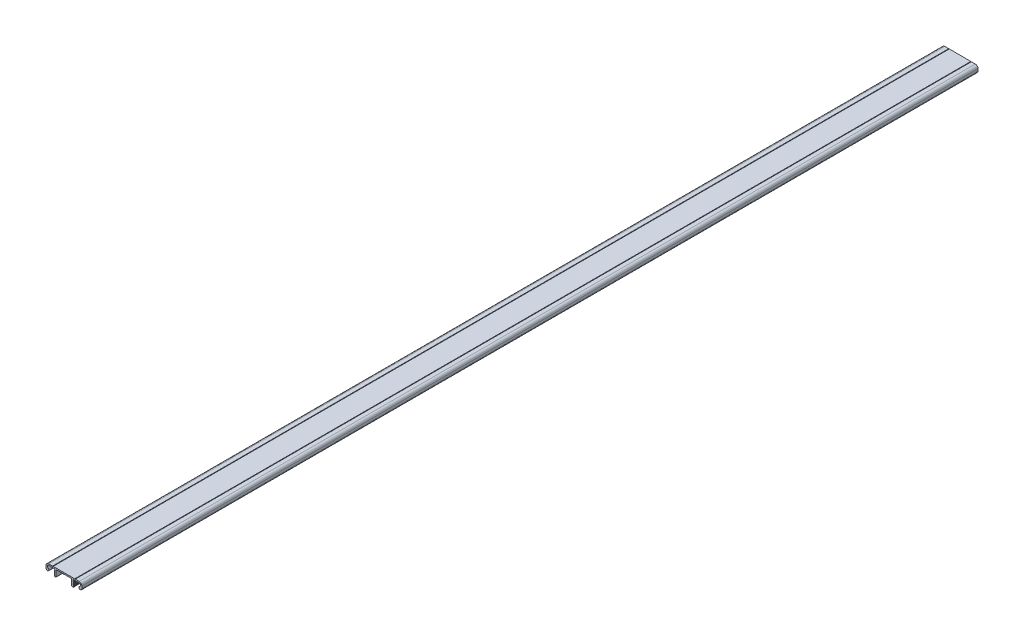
ISO-10303-21;
HEADER;
FILE_DESCRIPTION(('STEP AP214'),'2;1');
FILE_NAME('part.step','',(''),(''),'','','');
FILE_SCHEMA(('AUTOMOTIVE_DESIGN { 1 0 10303 214 1 1 1 1 }'));
ENDSEC;
DATA;
#1=APPLICATION_CONTEXT('core data for automotive mechanical design processes');
#2=APPLICATION_PROTOCOL_DEFINITION('international standard','automotive_design',2000,#1);
#3=PRODUCT_CONTEXT('',#1,'mechanical');
#4=PRODUCT('Part','Part','',(#3));
#5=PRODUCT_RELATED_PRODUCT_CATEGORY('part','',(#4));
#6=PRODUCT_DEFINITION_FORMATION('','',#4);
#7=PRODUCT_DEFINITION_CONTEXT('part definition',#1,'design');
#8=PRODUCT_DEFINITION('design','',#6,#7);
#9=PRODUCT_DEFINITION_SHAPE('','',#8);
#10=(LENGTH_UNIT() NAMED_UNIT(*) SI_UNIT(.MILLI.,.METRE.));
#11=(NAMED_UNIT(*) PLANE_ANGLE_UNIT() SI_UNIT($,.RADIAN.));
#12=(NAMED_UNIT(*) SI_UNIT($,.STERADIAN.) SOLID_ANGLE_UNIT());
#13=UNCERTAINTY_MEASURE_WITH_UNIT(LENGTH_MEASURE(1.E-05),#10,'distance_accuracy_value','');
#14=(GEOMETRIC_REPRESENTATION_CONTEXT(3) GLOBAL_UNCERTAINTY_ASSIGNED_CONTEXT((#13)) GLOBAL_UNIT_ASSIGNED_CONTEXT((#10,
#11,#12)) REPRESENTATION_CONTEXT('',''));
#15=CARTESIAN_POINT('',(0.,0.,0.));
#16=DIRECTION('',(0.,0.,1.));
#17=DIRECTION('',(1.,0.,0.));
#18=AXIS2_PLACEMENT_3D('',#15,#16,#17);
#19=CARTESIAN_POINT('',(-51.5378748,61.559178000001,1000.));
#20=DIRECTION('',(0.,0.,-1.));
#21=DIRECTION('',(-1.,0.,0.));
#22=AXIS2_PLACEMENT_3D('',#19,#20,#21);
#23=CYLINDRICAL_SURFACE('',#22,0.500000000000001);
#24=CARTESIAN_POINT('',(-51.5378748,61.559178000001,0.));
#25=DIRECTION('',(0.,0.,-1.));
#26=DIRECTION('',(1.,0.,0.));
#27=AXIS2_PLACEMENT_3D('',#24,#25,#26);
#28=CIRCLE('',#27,0.500000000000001);
#29=CARTESIAN_POINT('',(-52.0378748,61.559178,0.));
#30=VERTEX_POINT('',#29);
#31=CARTESIAN_POINT('',(-51.5378758,62.059178,0.));
#32=VERTEX_POINT('',#31);
#33=EDGE_CURVE('E505',#30,#32,#28,.T.);
#34=ORIENTED_EDGE('',*,*,#33,.T.);
#35=DIRECTION('',(0.,0.,-1.));
#36=VECTOR('',#35,1.);
#37=CARTESIAN_POINT('',(-51.5378758,62.059178,1000.));
#38=LINE('',#37,#36);
#39=CARTESIAN_POINT('',(-51.5378758,62.059178,1000.));
#40=VERTEX_POINT('',#39);
#41=EDGE_CURVE('E11',#40,#32,#38,.T.);
#42=ORIENTED_EDGE('',*,*,#41,.F.);
#43=CARTESIAN_POINT('',(-51.5378748,61.559178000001,1000.));
#44=DIRECTION('',(0.,0.,-1.));
#45=DIRECTION('',(1.,0.,0.));
#46=AXIS2_PLACEMENT_3D('',#43,#44,#45);
#47=CIRCLE('',#46,0.500000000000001);
#48=CARTESIAN_POINT('',(-52.0378748,61.559178,1000.));
#49=VERTEX_POINT('',#48);
#50=EDGE_CURVE('E650',#49,#40,#47,.T.);
#51=ORIENTED_EDGE('',*,*,#50,.F.);
#52=DIRECTION('',(0.,0.,-1.));
#53=VECTOR('',#52,1.);
#54=CARTESIAN_POINT('',(-52.0378748,61.559178,1000.));
#55=LINE('',#54,#53);
#56=EDGE_CURVE('E501',#49,#30,#55,.T.);
#57=ORIENTED_EDGE('',*,*,#56,.T.);
#58=EDGE_LOOP('',(#34,#42,#51,#57));
#59=FACE_BOUND('',#58,.T.);
#60=ADVANCED_FACE('F39',(#59),#23,.F.);
#61=CARTESIAN_POINT('',(-51.5378758,62.059178,1000.));
#62=DIRECTION('',(-2.54660866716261E-07,0.999999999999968,0.));
#63=DIRECTION('',(-0.999999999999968,-2.54660866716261E-07,0.));
#64=AXIS2_PLACEMENT_3D('',#61,#62,#63);
#65=PLANE('',#64);
#66=DIRECTION('',(0.999999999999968,2.54660866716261E-07,0.));
#67=VECTOR('',#66,1.);
#68=CARTESIAN_POINT('',(-51.5378758,62.059178,0.));
#69=LINE('',#68,#67);
#70=CARTESIAN_POINT('',(-43.6842938,62.05918,0.));
#71=VERTEX_POINT('',#70);
#72=EDGE_CURVE('E508',#32,#71,#69,.T.);
#73=ORIENTED_EDGE('',*,*,#72,.T.);
#74=DIRECTION('',(0.,0.,-1.));
#75=VECTOR('',#74,1.);
#76=CARTESIAN_POINT('',(-43.6842938,62.05918,1000.));
#77=LINE('',#76,#75);
#78=CARTESIAN_POINT('',(-43.6842938,62.05918,1000.));
#79=VERTEX_POINT('',#78);
#80=EDGE_CURVE('E47',#79,#71,#77,.T.);
#81=ORIENTED_EDGE('',*,*,#80,.F.);
#82=DIRECTION('',(0.999999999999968,2.54660866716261E-07,0.));
#83=VECTOR('',#82,1.);
#84=CARTESIAN_POINT('',(-51.5378758,62.059178,1000.));
#85=LINE('',#84,#83);
#86=EDGE_CURVE('E287',#40,#79,#85,.T.);
#87=ORIENTED_EDGE('',*,*,#86,.F.);
#88=ORIENTED_EDGE('',*,*,#41,.T.);
#89=EDGE_LOOP('',(#73,#81,#87,#88));
#90=FACE_BOUND('',#89,.T.);
#91=ADVANCED_FACE('F1016',(#90),#65,.F.);
#92=CARTESIAN_POINT('',(-43.3378834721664,62.1091788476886,1000.));
#93=DIRECTION('',(0.,0.,-1.));
#94=DIRECTION('',(-1.,0.,0.));
#95=AXIS2_PLACEMENT_3D('',#92,#93,#94);
#96=CYLINDRICAL_SURFACE('',#95,0.350000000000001);
#97=CARTESIAN_POINT('',(-43.3378834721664,62.1091788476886,0.));
#98=DIRECTION('',(0.,0.,1.));
#99=DIRECTION('',(1.,0.,0.));
#100=AXIS2_PLACEMENT_3D('',#97,#98,#99);
#101=CIRCLE('',#100,0.350000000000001);
#102=CARTESIAN_POINT('',(-42.991473,62.059181,0.));
#103=VERTEX_POINT('',#102);
#104=EDGE_CURVE('E510',#71,#103,#101,.T.);
#105=ORIENTED_EDGE('',*,*,#104,.T.);
#106=DIRECTION('',(0.,0.,-1.));
#107=VECTOR('',#106,1.);
#108=CARTESIAN_POINT('',(-42.991473,62.059181,1000.));
#109=LINE('',#108,#107);
#110=CARTESIAN_POINT('',(-42.991473,62.059181,1000.));
#111=VERTEX_POINT('',#110);
#112=EDGE_CURVE('E845',#111,#103,#109,.T.);
#113=ORIENTED_EDGE('',*,*,#112,.F.);
#114=CARTESIAN_POINT('',(-43.3378834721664,62.1091788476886,1000.));
#115=DIRECTION('',(0.,0.,1.));
#116=DIRECTION('',(1.,0.,0.));
#117=AXIS2_PLACEMENT_3D('',#114,#115,#116);
#118=CIRCLE('',#117,0.350000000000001);
#119=EDGE_CURVE('E853',#79,#111,#118,.T.);
#120=ORIENTED_EDGE('',*,*,#119,.F.);
#121=ORIENTED_EDGE('',*,*,#80,.T.);
#122=EDGE_LOOP('',(#105,#113,#120,#121));
#123=FACE_BOUND('',#122,.T.);
#124=ADVANCED_FACE('F851',(#123),#96,.T.);
#125=CARTESIAN_POINT('',(-42.991473,62.059181,1000.));
#126=DIRECTION('',(2.54660769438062E-07,0.999999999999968,0.));
#127=DIRECTION('',(-0.999999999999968,2.54660769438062E-07,0.));
#128=AXIS2_PLACEMENT_3D('',#125,#126,#127);
#129=PLANE('',#128);
#130=DIRECTION('',(0.999999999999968,-2.54660769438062E-07,0.));
#131=VECTOR('',#130,1.);
#132=CARTESIAN_POINT('',(-42.991473,62.059181,0.));
#133=LINE('',#132,#131);
#134=CARTESIAN_POINT('',(-35.137888,62.059179,0.));
#135=VERTEX_POINT('',#134);
#136=EDGE_CURVE('E512',#103,#135,#133,.T.);
#137=ORIENTED_EDGE('',*,*,#136,.T.);
#138=DIRECTION('',(0.,0.,-1.));
#139=VECTOR('',#138,1.);
#140=CARTESIAN_POINT('',(-35.137888,62.059179,1000.));
#141=LINE('',#140,#139);
#142=CARTESIAN_POINT('',(-35.137888,62.059179,1000.));
#143=VERTEX_POINT('',#142);
#144=EDGE_CURVE('E842',#143,#135,#141,.T.);
#145=ORIENTED_EDGE('',*,*,#144,.F.);
#146=DIRECTION('',(0.999999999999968,-2.54660769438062E-07,0.));
#147=VECTOR('',#146,1.);
#148=CARTESIAN_POINT('',(-42.991473,62.059181,1000.));
#149=LINE('',#148,#147);
#150=EDGE_CURVE('E871',#111,#143,#149,.T.);
#151=ORIENTED_EDGE('',*,*,#150,.F.);
#152=ORIENTED_EDGE('',*,*,#112,.T.);
#153=EDGE_LOOP('',(#137,#145,#151,#152));
#154=FACE_BOUND('',#153,.T.);
#155=ADVANCED_FACE('F862',(#154),#129,.F.);
#156=CARTESIAN_POINT('',(-35.1378882,61.5591790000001,1000.));
#157=DIRECTION('',(0.,0.,-1.));
#158=DIRECTION('',(-1.,0.,0.));
#159=AXIS2_PLACEMENT_3D('',#156,#157,#158);
#160=CYLINDRICAL_SURFACE('',#159,0.5);
#161=CARTESIAN_POINT('',(-35.1378882,61.5591790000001,0.));
#162=DIRECTION('',(0.,0.,-1.));
#163=DIRECTION('',(1.,0.,0.));
#164=AXIS2_PLACEMENT_3D('',#161,#162,#163);
#165=CIRCLE('',#164,0.5);
#166=CARTESIAN_POINT('',(-34.6378882,61.559179,0.));
#167=VERTEX_POINT('',#166);
#168=EDGE_CURVE('E514',#135,#167,#165,.T.);
#169=ORIENTED_EDGE('',*,*,#168,.T.);
#170=DIRECTION('',(0.,0.,-1.));
#171=VECTOR('',#170,1.);
#172=CARTESIAN_POINT('',(-34.6378882,61.559179,1000.));
#173=LINE('',#172,#171);
#174=CARTESIAN_POINT('',(-34.6378882,61.559179,1000.));
#175=VERTEX_POINT('',#174);
#176=EDGE_CURVE('E839',#175,#167,#173,.T.);
#177=ORIENTED_EDGE('',*,*,#176,.F.);
#178=CARTESIAN_POINT('',(-35.1378882,61.5591790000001,1000.));
#179=DIRECTION('',(0.,0.,-1.));
#180=DIRECTION('',(1.,0.,0.));
#181=AXIS2_PLACEMENT_3D('',#178,#179,#180);
#182=CIRCLE('',#181,0.5);
#183=EDGE_CURVE('E868',#143,#175,#182,.T.);
#184=ORIENTED_EDGE('',*,*,#183,.F.);
#185=ORIENTED_EDGE('',*,*,#144,.T.);
#186=EDGE_LOOP('',(#169,#177,#184,#185));
#187=FACE_BOUND('',#186,.T.);
#188=ADVANCED_FACE('F866',(#187),#160,.F.);
#189=CARTESIAN_POINT('',(-34.6378862,55.0591872,1000.));
#190=DIRECTION('',(0.999999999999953,3.07692695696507E-07,0.));
#191=DIRECTION('',(-3.07692695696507E-07,0.999999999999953,0.));
#192=AXIS2_PLACEMENT_3D('',#189,#190,#191);
#193=PLANE('',#192);
#194=DIRECTION('',(3.07692695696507E-07,-0.999999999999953,0.));
#195=VECTOR('',#194,1.);
#196=CARTESIAN_POINT('',(-34.6378862,55.0591872,0.));
#197=LINE('',#196,#195);
#198=CARTESIAN_POINT('',(-34.6378862,55.0591872,0.));
#199=VERTEX_POINT('',#198);
#200=EDGE_CURVE('E516',#167,#199,#197,.T.);
#201=ORIENTED_EDGE('',*,*,#200,.T.);
#202=DIRECTION('',(0.,0.,-1.));
#203=VECTOR('',#202,1.);
#204=CARTESIAN_POINT('',(-34.6378862,55.0591872,1000.));
#205=LINE('',#204,#203);
#206=CARTESIAN_POINT('',(-34.6378862,55.0591872,1000.));
#207=VERTEX_POINT('',#206);
#208=EDGE_CURVE('E836',#207,#199,#205,.T.);
#209=ORIENTED_EDGE('',*,*,#208,.F.);
#210=DIRECTION('',(3.07692695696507E-07,-0.999999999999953,0.));
#211=VECTOR('',#210,1.);
#212=CARTESIAN_POINT('',(-34.6378862,55.0591872,1000.));
#213=LINE('',#212,#211);
#214=EDGE_CURVE('E870',#175,#207,#213,.T.);
#215=ORIENTED_EDGE('',*,*,#214,.F.);
#216=ORIENTED_EDGE('',*,*,#176,.T.);
#217=EDGE_LOOP('',(#201,#209,#215,#216));
#218=FACE_BOUND('',#217,.T.);
#219=ADVANCED_FACE('F1029',(#218),#193,.F.);
#220=CARTESIAN_POINT('',(-34.137886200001,55.0591882,1000.));
#221=DIRECTION('',(0.,0.,-1.));
#222=DIRECTION('',(-1.,0.,0.));
#223=AXIS2_PLACEMENT_3D('',#220,#221,#222);
#224=CYLINDRICAL_SURFACE('',#223,0.500000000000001);
#225=CARTESIAN_POINT('',(-34.137886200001,55.0591882,0.));
#226=DIRECTION('',(0.,0.,1.));
#227=DIRECTION('',(1.,0.,0.));
#228=AXIS2_PLACEMENT_3D('',#225,#226,#227);
#229=CIRCLE('',#228,0.500000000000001);
#230=CARTESIAN_POINT('',(-34.1378862,54.5591882,0.));
#231=VERTEX_POINT('',#230);
#232=EDGE_CURVE('E518',#199,#231,#229,.T.);
#233=ORIENTED_EDGE('',*,*,#232,.T.);
#234=DIRECTION('',(0.,0.,-1.));
#235=VECTOR('',#234,1.);
#236=CARTESIAN_POINT('',(-34.1378862,54.5591882,1000.));
#237=LINE('',#236,#235);
#238=CARTESIAN_POINT('',(-34.1378862,54.5591882,1000.));
#239=VERTEX_POINT('',#238);
#240=EDGE_CURVE('E833',#239,#231,#237,.T.);
#241=ORIENTED_EDGE('',*,*,#240,.F.);
#242=CARTESIAN_POINT('',(-34.137886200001,55.0591882,1000.));
#243=DIRECTION('',(0.,0.,1.));
#244=DIRECTION('',(1.,0.,0.));
#245=AXIS2_PLACEMENT_3D('',#242,#243,#244);
#246=CIRCLE('',#245,0.500000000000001);
#247=EDGE_CURVE('E873',#207,#239,#246,.T.);
#248=ORIENTED_EDGE('',*,*,#247,.F.);
#249=ORIENTED_EDGE('',*,*,#208,.T.);
#250=EDGE_LOOP('',(#233,#241,#248,#249));
#251=FACE_BOUND('',#250,.T.);
#252=ADVANCED_FACE('F1032',(#251),#224,.T.);
#253=CARTESIAN_POINT('',(-33.0878972,54.5591862,1000.));
#254=DIRECTION('',(1.90478185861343E-06,0.999999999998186,0.));
#255=DIRECTION('',(-0.999999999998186,1.90478185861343E-06,0.));
#256=AXIS2_PLACEMENT_3D('',#253,#254,#255);
#257=PLANE('',#256);
#258=DIRECTION('',(0.999999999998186,-1.90478185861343E-06,0.));
#259=VECTOR('',#258,1.);
#260=CARTESIAN_POINT('',(-33.0878972,54.5591862,0.));
#261=LINE('',#260,#259);
#262=CARTESIAN_POINT('',(-33.0878972,54.5591862,0.));
#263=VERTEX_POINT('',#262);
#264=EDGE_CURVE('E520',#231,#263,#261,.T.);
#265=ORIENTED_EDGE('',*,*,#264,.T.);
#266=DIRECTION('',(0.,0.,-1.));
#267=VECTOR('',#266,1.);
#268=CARTESIAN_POINT('',(-33.0878972,54.5591862,1000.));
#269=LINE('',#268,#267);
#270=CARTESIAN_POINT('',(-33.0878972,54.5591862,1000.));
#271=VERTEX_POINT('',#270);
#272=EDGE_CURVE('E830',#271,#263,#269,.T.);
#273=ORIENTED_EDGE('',*,*,#272,.F.);
#274=DIRECTION('',(0.999999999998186,-1.90478185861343E-06,0.));
#275=VECTOR('',#274,1.);
#276=CARTESIAN_POINT('',(-33.0878972,54.5591862,1000.));
#277=LINE('',#276,#275);
#278=EDGE_CURVE('E879',#239,#271,#277,.T.);
#279=ORIENTED_EDGE('',*,*,#278,.F.);
#280=ORIENTED_EDGE('',*,*,#240,.T.);
#281=EDGE_LOOP('',(#265,#273,#279,#280));
#282=FACE_BOUND('',#281,.T.);
#283=ADVANCED_FACE('F1036',(#282),#257,.F.);
#284=CARTESIAN_POINT('',(-33.087896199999,55.059186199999,1000.));
#285=DIRECTION('',(0.,0.,-1.));
#286=DIRECTION('',(-1.,0.,0.));
#287=AXIS2_PLACEMENT_3D('',#284,#285,#286);
#288=CYLINDRICAL_SURFACE('',#287,0.500000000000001);
#289=CARTESIAN_POINT('',(-33.087896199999,55.059186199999,0.));
#290=DIRECTION('',(0.,0.,1.));
#291=DIRECTION('',(1.,0.,0.));
#292=AXIS2_PLACEMENT_3D('',#289,#290,#291);
#293=CIRCLE('',#292,0.500000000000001);
#294=CARTESIAN_POINT('',(-32.5878962,55.0591872,0.));
#295=VERTEX_POINT('',#294);
#296=EDGE_CURVE('E522',#263,#295,#293,.T.);
#297=ORIENTED_EDGE('',*,*,#296,.T.);
#298=DIRECTION('',(0.,0.,-1.));
#299=VECTOR('',#298,1.);
#300=CARTESIAN_POINT('',(-32.5878962,55.0591872,1000.));
#301=LINE('',#300,#299);
#302=CARTESIAN_POINT('',(-32.5878962,55.0591872,1000.));
#303=VERTEX_POINT('',#302);
#304=EDGE_CURVE('E827',#303,#295,#301,.T.);
#305=ORIENTED_EDGE('',*,*,#304,.F.);
#306=CARTESIAN_POINT('',(-33.087896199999,55.059186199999,1000.));
#307=DIRECTION('',(0.,0.,1.));
#308=DIRECTION('',(1.,0.,0.));
#309=AXIS2_PLACEMENT_3D('',#306,#307,#308);
#310=CIRCLE('',#309,0.500000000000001);
#311=EDGE_CURVE('E881',#271,#303,#310,.T.);
#312=ORIENTED_EDGE('',*,*,#311,.F.);
#313=ORIENTED_EDGE('',*,*,#272,.T.);
#314=EDGE_LOOP('',(#297,#305,#312,#313));
#315=FACE_BOUND('',#314,.T.);
#316=ADVANCED_FACE('F1040',(#315),#288,.T.);
#317=CARTESIAN_POINT('',(-32.5878962,55.0591872,1000.));
#318=DIRECTION('',(-0.999999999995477,-3.00787159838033E-06,0.));
#319=DIRECTION('',(3.00787159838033E-06,-0.999999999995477,0.));
#320=AXIS2_PLACEMENT_3D('',#317,#318,#319);
#321=PLANE('',#320);
#322=DIRECTION('',(-3.00787159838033E-06,0.999999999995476,0.));
#323=VECTOR('',#322,1.);
#324=CARTESIAN_POINT('',(-32.5878962,55.0591872,0.));
#325=LINE('',#324,#323);
#326=CARTESIAN_POINT('',(-32.5878972,55.3916482,0.));
#327=VERTEX_POINT('',#326);
#328=EDGE_CURVE('E524',#295,#327,#325,.T.);
#329=ORIENTED_EDGE('',*,*,#328,.T.);
#330=DIRECTION('',(0.,0.,-1.));
#331=VECTOR('',#330,1.);
#332=CARTESIAN_POINT('',(-32.5878972,55.3916482,1000.));
#333=LINE('',#332,#331);
#334=CARTESIAN_POINT('',(-32.5878972,55.3916482,1000.));
#335=VERTEX_POINT('',#334);
#336=EDGE_CURVE('E824',#335,#327,#333,.T.);
#337=ORIENTED_EDGE('',*,*,#336,.F.);
#338=DIRECTION('',(-3.00787159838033E-06,0.999999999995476,0.));
#339=VECTOR('',#338,1.);
#340=CARTESIAN_POINT('',(-32.5878962,55.0591872,1000.));
#341=LINE('',#340,#339);
#342=EDGE_CURVE('E883',#303,#335,#341,.T.);
#343=ORIENTED_EDGE('',*,*,#342,.F.);
#344=ORIENTED_EDGE('',*,*,#304,.T.);
#345=EDGE_LOOP('',(#329,#337,#343,#344));
#346=FACE_BOUND('',#345,.T.);
#347=ADVANCED_FACE('F1044',(#346),#321,.F.);
#348=CARTESIAN_POINT('',(-32.5878972,55.3916482,1000.));
#349=DIRECTION('',(-0.500002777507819,-0.866023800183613,0.));
#350=DIRECTION('',(0.866023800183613,-0.500002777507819,0.));
#351=AXIS2_PLACEMENT_3D('',#348,#349,#350);
#352=PLANE('',#351);
#353=DIRECTION('',(-0.866023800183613,0.500002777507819,0.));
#354=VECTOR('',#353,1.);
#355=CARTESIAN_POINT('',(-32.5878972,55.3916482,0.));
#356=LINE('',#355,#354);
#357=CARTESIAN_POINT('',(-33.1378972,55.7091932,0.));
#358=VERTEX_POINT('',#357);
#359=EDGE_CURVE('E526',#327,#358,#356,.T.);
#360=ORIENTED_EDGE('',*,*,#359,.T.);
#361=DIRECTION('',(0.,0.,-1.));
#362=VECTOR('',#361,1.);
#363=CARTESIAN_POINT('',(-33.1378972,55.7091932,1000.));
#364=LINE('',#363,#362);
#365=CARTESIAN_POINT('',(-33.1378972,55.7091932,1000.));
#366=VERTEX_POINT('',#365);
#367=EDGE_CURVE('E821',#366,#358,#364,.T.);
#368=ORIENTED_EDGE('',*,*,#367,.F.);
#369=DIRECTION('',(-0.866023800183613,0.500002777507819,0.));
#370=VECTOR('',#369,1.);
#371=CARTESIAN_POINT('',(-32.5878972,55.3916482,1000.));
#372=LINE('',#371,#370);
#373=EDGE_CURVE('E885',#335,#366,#372,.T.);
#374=ORIENTED_EDGE('',*,*,#373,.F.);
#375=ORIENTED_EDGE('',*,*,#336,.T.);
#376=EDGE_LOOP('',(#360,#368,#374,#375));
#377=FACE_BOUND('',#376,.T.);
#378=ADVANCED_FACE('F1048',(#377),#352,.F.);
#379=CARTESIAN_POINT('',(-33.1378972,55.7091932,1000.));
#380=DIRECTION('',(-0.499998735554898,0.866026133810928,0.));
#381=DIRECTION('',(-0.866026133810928,-0.499998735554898,0.));
#382=AXIS2_PLACEMENT_3D('',#379,#380,#381);
#383=PLANE('',#382);
#384=DIRECTION('',(0.866026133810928,0.499998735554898,0.));
#385=VECTOR('',#384,1.);
#386=CARTESIAN_POINT('',(-33.1378972,55.7091932,0.));
#387=LINE('',#386,#385);
#388=CARTESIAN_POINT('',(-32.5878982,56.0267342,0.));
#389=VERTEX_POINT('',#388);
#390=EDGE_CURVE('E528',#358,#389,#387,.T.);
#391=ORIENTED_EDGE('',*,*,#390,.T.);
#392=DIRECTION('',(0.,0.,-1.));
#393=VECTOR('',#392,1.);
#394=CARTESIAN_POINT('',(-32.5878982,56.0267342,1000.));
#395=LINE('',#394,#393);
#396=CARTESIAN_POINT('',(-32.5878982,56.0267342,1000.));
#397=VERTEX_POINT('',#396);
#398=EDGE_CURVE('E818',#397,#389,#395,.T.);
#399=ORIENTED_EDGE('',*,*,#398,.F.);
#400=DIRECTION('',(0.866026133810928,0.499998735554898,0.));
#401=VECTOR('',#400,1.);
#402=CARTESIAN_POINT('',(-33.1378972,55.7091932,1000.));
#403=LINE('',#402,#401);
#404=EDGE_CURVE('E887',#366,#397,#403,.T.);
#405=ORIENTED_EDGE('',*,*,#404,.F.);
#406=ORIENTED_EDGE('',*,*,#367,.T.);
#407=EDGE_LOOP('',(#391,#399,#405,#406));
#408=FACE_BOUND('',#407,.T.);
#409=ADVANCED_FACE('F1052',(#408),#383,.F.);
#410=CARTESIAN_POINT('',(-32.5878982,56.0267342,1000.));
#411=DIRECTION('',(-1.,0.,0.));
#412=DIRECTION('',(0.,0.,1.));
#413=AXIS2_PLACEMENT_3D('',#410,#411,#412);
#414=PLANE('',#413);
#415=DIRECTION('',(0.,1.,0.));
#416=VECTOR('',#415,1.);
#417=CARTESIAN_POINT('',(-32.5878982,56.0267342,0.));
#418=LINE('',#417,#416);
#419=CARTESIAN_POINT('',(-32.5878982,56.7916492,0.));
#420=VERTEX_POINT('',#419);
#421=EDGE_CURVE('E530',#389,#420,#418,.T.);
#422=ORIENTED_EDGE('',*,*,#421,.T.);
#423=DIRECTION('',(0.,0.,-1.));
#424=VECTOR('',#423,1.);
#425=CARTESIAN_POINT('',(-32.5878982,56.7916492,1000.));
#426=LINE('',#425,#424);
#427=CARTESIAN_POINT('',(-32.5878982,56.7916492,1000.));
#428=VERTEX_POINT('',#427);
#429=EDGE_CURVE('E815',#428,#420,#426,.T.);
#430=ORIENTED_EDGE('',*,*,#429,.F.);
#431=DIRECTION('',(0.,1.,0.));
#432=VECTOR('',#431,1.);
#433=CARTESIAN_POINT('',(-32.5878982,56.0267342,1000.));
#434=LINE('',#433,#432);
#435=EDGE_CURVE('E889',#397,#428,#434,.T.);
#436=ORIENTED_EDGE('',*,*,#435,.F.);
#437=ORIENTED_EDGE('',*,*,#398,.T.);
#438=EDGE_LOOP('',(#422,#430,#436,#437));
#439=FACE_BOUND('',#438,.T.);
#440=ADVANCED_FACE('F1056',(#439),#414,.F.);
#441=CARTESIAN_POINT('',(-32.5878982,56.7916492,1000.));
#442=DIRECTION('',(-0.500000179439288,-0.866025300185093,0.));
#443=DIRECTION('',(0.866025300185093,-0.500000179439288,0.));
#444=AXIS2_PLACEMENT_3D('',#441,#442,#443);
#445=PLANE('',#444);
#446=DIRECTION('',(-0.866025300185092,0.500000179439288,0.));
#447=VECTOR('',#446,1.);
#448=CARTESIAN_POINT('',(-32.5878982,56.7916492,0.));
#449=LINE('',#448,#447);
#450=CARTESIAN_POINT('',(-33.1378982,57.109192,0.));
#451=VERTEX_POINT('',#450);
#452=EDGE_CURVE('E532',#420,#451,#449,.T.);
#453=ORIENTED_EDGE('',*,*,#452,.T.);
#454=DIRECTION('',(0.,0.,-1.));
#455=VECTOR('',#454,1.);
#456=CARTESIAN_POINT('',(-33.1378982,57.109192,1000.));
#457=LINE('',#456,#455);
#458=CARTESIAN_POINT('',(-33.1378982,57.109192,1000.));
#459=VERTEX_POINT('',#458);
#460=EDGE_CURVE('E812',#459,#451,#457,.T.);
#461=ORIENTED_EDGE('',*,*,#460,.F.);
#462=DIRECTION('',(-0.866025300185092,0.500000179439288,0.));
#463=VECTOR('',#462,1.);
#464=CARTESIAN_POINT('',(-32.5878982,56.7916492,1000.));
#465=LINE('',#464,#463);
#466=EDGE_CURVE('E891',#428,#459,#465,.T.);
#467=ORIENTED_EDGE('',*,*,#466,.F.);
#468=ORIENTED_EDGE('',*,*,#429,.T.);
#469=EDGE_LOOP('',(#453,#461,#467,#468));
#470=FACE_BOUND('',#469,.T.);
#471=ADVANCED_FACE('F1060',(#470),#445,.F.);
#472=CARTESIAN_POINT('',(-33.1378982,57.109192,1000.));
#473=DIRECTION('',(-0.500000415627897,0.866025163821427,0.));
#474=DIRECTION('',(-0.866025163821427,-0.500000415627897,0.));
#475=AXIS2_PLACEMENT_3D('',#472,#473,#474);
#476=PLANE('',#475);
#477=DIRECTION('',(0.866025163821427,0.500000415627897,0.));
#478=VECTOR('',#477,1.);
#479=CARTESIAN_POINT('',(-33.1378982,57.109192,0.));
#480=LINE('',#479,#478);
#481=CARTESIAN_POINT('',(-32.5878982,57.426735,0.));
#482=VERTEX_POINT('',#481);
#483=EDGE_CURVE('E534',#451,#482,#480,.T.);
#484=ORIENTED_EDGE('',*,*,#483,.T.);
#485=DIRECTION('',(0.,0.,-1.));
#486=VECTOR('',#485,1.);
#487=CARTESIAN_POINT('',(-32.5878982,57.426735,1000.));
#488=LINE('',#487,#486);
#489=CARTESIAN_POINT('',(-32.5878982,57.426735,1000.));
#490=VERTEX_POINT('',#489);
#491=EDGE_CURVE('E809',#490,#482,#488,.T.);
#492=ORIENTED_EDGE('',*,*,#491,.F.);
#493=DIRECTION('',(0.866025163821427,0.500000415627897,0.));
#494=VECTOR('',#493,1.);
#495=CARTESIAN_POINT('',(-33.1378982,57.109192,1000.));
#496=LINE('',#495,#494);
#497=EDGE_CURVE('E893',#459,#490,#496,.T.);
#498=ORIENTED_EDGE('',*,*,#497,.F.);
#499=ORIENTED_EDGE('',*,*,#460,.T.);
#500=EDGE_LOOP('',(#484,#492,#498,#499));
#501=FACE_BOUND('',#500,.T.);
#502=ADVANCED_FACE('F1064',(#501),#476,.F.);
#503=CARTESIAN_POINT('',(-32.5878982,57.426735,1000.));
#504=DIRECTION('',(-0.999999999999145,-1.30735360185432E-06,0.));
#505=DIRECTION('',(1.30735360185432E-06,-0.999999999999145,0.));
#506=AXIS2_PLACEMENT_3D('',#503,#504,#505);
#507=PLANE('',#506);
#508=DIRECTION('',(-1.30735360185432E-06,0.999999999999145,0.));
#509=VECTOR('',#508,1.);
#510=CARTESIAN_POINT('',(-32.5878982,57.426735,0.));
#511=LINE('',#510,#509);
#512=CARTESIAN_POINT('',(-32.5878992,58.191639,0.));
#513=VERTEX_POINT('',#512);
#514=EDGE_CURVE('E536',#482,#513,#511,.T.);
#515=ORIENTED_EDGE('',*,*,#514,.T.);
#516=DIRECTION('',(0.,0.,-1.));
#517=VECTOR('',#516,1.);
#518=CARTESIAN_POINT('',(-32.5878992,58.191639,1000.));
#519=LINE('',#518,#517);
#520=CARTESIAN_POINT('',(-32.5878992,58.191639,1000.));
#521=VERTEX_POINT('',#520);
#522=EDGE_CURVE('E806',#521,#513,#519,.T.);
#523=ORIENTED_EDGE('',*,*,#522,.F.);
#524=DIRECTION('',(-1.30735360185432E-06,0.999999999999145,0.));
#525=VECTOR('',#524,1.);
#526=CARTESIAN_POINT('',(-32.5878982,57.426735,1000.));
#527=LINE('',#526,#525);
#528=EDGE_CURVE('E895',#490,#521,#527,.T.);
#529=ORIENTED_EDGE('',*,*,#528,.F.);
#530=ORIENTED_EDGE('',*,*,#491,.T.);
#531=EDGE_LOOP('',(#515,#523,#529,#530));
#532=FACE_BOUND('',#531,.T.);
#533=ADVANCED_FACE('F1068',(#532),#507,.F.);
#534=CARTESIAN_POINT('',(-32.5878992,58.191639,1000.));
#535=DIRECTION('',(-0.500000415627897,-0.866025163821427,0.));
#536=DIRECTION('',(0.866025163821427,-0.500000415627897,0.));
#537=AXIS2_PLACEMENT_3D('',#534,#535,#536);
#538=PLANE('',#537);
#539=DIRECTION('',(-0.866025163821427,0.500000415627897,0.));
#540=VECTOR('',#539,1.);
#541=CARTESIAN_POINT('',(-32.5878992,58.191639,0.));
#542=LINE('',#541,#540);
#543=CARTESIAN_POINT('',(-33.1378992,58.509182,0.));
#544=VERTEX_POINT('',#543);
#545=EDGE_CURVE('E538',#513,#544,#542,.T.);
#546=ORIENTED_EDGE('',*,*,#545,.T.);
#547=DIRECTION('',(0.,0.,-1.));
#548=VECTOR('',#547,1.);
#549=CARTESIAN_POINT('',(-33.1378992,58.509182,1000.));
#550=LINE('',#549,#548);
#551=CARTESIAN_POINT('',(-33.1378992,58.509182,1000.));
#552=VERTEX_POINT('',#551);
#553=EDGE_CURVE('E803',#552,#544,#550,.T.);
#554=ORIENTED_EDGE('',*,*,#553,.F.);
#555=DIRECTION('',(-0.866025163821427,0.500000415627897,0.));
#556=VECTOR('',#555,1.);
#557=CARTESIAN_POINT('',(-32.5878992,58.191639,1000.));
#558=LINE('',#557,#556);
#559=EDGE_CURVE('E897',#521,#552,#558,.T.);
#560=ORIENTED_EDGE('',*,*,#559,.F.);
#561=ORIENTED_EDGE('',*,*,#522,.T.);
#562=EDGE_LOOP('',(#546,#554,#560,#561));
#563=FACE_BOUND('',#562,.T.);
#564=ADVANCED_FACE('F1072',(#563),#538,.F.);
#565=CARTESIAN_POINT('',(-33.1378992,58.509182,1000.));
#566=DIRECTION('',(-0.499999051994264,0.866025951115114,0.));
#567=DIRECTION('',(-0.866025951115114,-0.499999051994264,0.));
#568=AXIS2_PLACEMENT_3D('',#565,#566,#567);
#569=PLANE('',#568);
#570=DIRECTION('',(0.866025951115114,0.499999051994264,0.));
#571=VECTOR('',#570,1.);
#572=CARTESIAN_POINT('',(-33.1378992,58.509182,0.));
#573=LINE('',#572,#571);
#574=CARTESIAN_POINT('',(-32.5878972,58.826725,0.));
#575=VERTEX_POINT('',#574);
#576=EDGE_CURVE('E540',#544,#575,#573,.T.);
#577=ORIENTED_EDGE('',*,*,#576,.T.);
#578=DIRECTION('',(0.,0.,-1.));
#579=VECTOR('',#578,1.);
#580=CARTESIAN_POINT('',(-32.5878972,58.826725,1000.));
#581=LINE('',#580,#579);
#582=CARTESIAN_POINT('',(-32.5878972,58.826725,1000.));
#583=VERTEX_POINT('',#582);
#584=EDGE_CURVE('E800',#583,#575,#581,.T.);
#585=ORIENTED_EDGE('',*,*,#584,.F.);
#586=DIRECTION('',(0.866025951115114,0.499999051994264,0.));
#587=VECTOR('',#586,1.);
#588=CARTESIAN_POINT('',(-33.1378992,58.509182,1000.));
#589=LINE('',#588,#587);
#590=EDGE_CURVE('E899',#552,#583,#589,.T.);
#591=ORIENTED_EDGE('',*,*,#590,.F.);
#592=ORIENTED_EDGE('',*,*,#553,.T.);
#593=EDGE_LOOP('',(#577,#585,#591,#592));
#594=FACE_BOUND('',#593,.T.);
#595=ADVANCED_FACE('F1076',(#594),#569,.F.);
#596=CARTESIAN_POINT('',(-32.5878972,58.826725,1000.));
#597=DIRECTION('',(-1.,0.,0.));
#598=DIRECTION('',(0.,0.,1.));
#599=AXIS2_PLACEMENT_3D('',#596,#597,#598);
#600=PLANE('',#599);
#601=DIRECTION('',(0.,1.,0.));
#602=VECTOR('',#601,1.);
#603=CARTESIAN_POINT('',(-32.5878972,58.826725,0.));
#604=LINE('',#603,#602);
#605=CARTESIAN_POINT('',(-32.5878972,59.591632,0.));
#606=VERTEX_POINT('',#605);
#607=EDGE_CURVE('E542',#575,#606,#604,.T.);
#608=ORIENTED_EDGE('',*,*,#607,.T.);
#609=DIRECTION('',(0.,0.,-1.));
#610=VECTOR('',#609,1.);
#611=CARTESIAN_POINT('',(-32.5878972,59.591632,1000.));
#612=LINE('',#611,#610);
#613=CARTESIAN_POINT('',(-32.5878972,59.591632,1000.));
#614=VERTEX_POINT('',#613);
#615=EDGE_CURVE('E797',#614,#606,#612,.T.);
#616=ORIENTED_EDGE('',*,*,#615,.F.);
#617=DIRECTION('',(0.,1.,0.));
#618=VECTOR('',#617,1.);
#619=CARTESIAN_POINT('',(-32.5878972,58.826725,1000.));
#620=LINE('',#619,#618);
#621=EDGE_CURVE('E901',#583,#614,#620,.T.);
#622=ORIENTED_EDGE('',*,*,#621,.F.);
#623=ORIENTED_EDGE('',*,*,#584,.T.);
#624=EDGE_LOOP('',(#608,#616,#622,#623));
#625=FACE_BOUND('',#624,.T.);
#626=ADVANCED_FACE('F1080',(#625),#600,.F.);
#627=CARTESIAN_POINT('',(-32.5878972,59.591632,1000.));
#628=DIRECTION('',(-0.499995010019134,-0.866028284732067,0.));
#629=DIRECTION('',(0.866028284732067,-0.499995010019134,0.));
#630=AXIS2_PLACEMENT_3D('',#627,#628,#629);
#631=PLANE('',#630);
#632=DIRECTION('',(-0.866028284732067,0.499995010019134,0.));
#633=VECTOR('',#632,1.);
#634=CARTESIAN_POINT('',(-32.5878972,59.591632,0.));
#635=LINE('',#634,#633);
#636=CARTESIAN_POINT('',(-33.1378982,59.909171,0.));
#637=VERTEX_POINT('',#636);
#638=EDGE_CURVE('E544',#606,#637,#635,.T.);
#639=ORIENTED_EDGE('',*,*,#638,.T.);
#640=DIRECTION('',(0.,0.,-1.));
#641=VECTOR('',#640,1.);
#642=CARTESIAN_POINT('',(-33.1378982,59.909171,1000.));
#643=LINE('',#642,#641);
#644=CARTESIAN_POINT('',(-33.1378982,59.909171,1000.));
#645=VERTEX_POINT('',#644);
#646=EDGE_CURVE('E794',#645,#637,#643,.T.);
#647=ORIENTED_EDGE('',*,*,#646,.F.);
#648=DIRECTION('',(-0.866028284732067,0.499995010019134,0.));
#649=VECTOR('',#648,1.);
#650=CARTESIAN_POINT('',(-32.5878972,59.591632,1000.));
#651=LINE('',#650,#649);
#652=EDGE_CURVE('E903',#614,#645,#651,.T.);
#653=ORIENTED_EDGE('',*,*,#652,.F.);
#654=ORIENTED_EDGE('',*,*,#615,.T.);
#655=EDGE_LOOP('',(#639,#647,#653,#654));
#656=FACE_BOUND('',#655,.T.);
#657=ADVANCED_FACE('F1084',(#656),#631,.F.);
#658=CARTESIAN_POINT('',(-33.1378982,59.909171,1000.));
#659=DIRECTION('',(-0.499996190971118,0.86602760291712,0.));
#660=DIRECTION('',(-0.86602760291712,-0.499996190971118,0.));
#661=AXIS2_PLACEMENT_3D('',#658,#659,#660);
#662=PLANE('',#661);
#663=DIRECTION('',(0.86602760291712,0.499996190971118,0.));
#664=VECTOR('',#663,1.);
#665=CARTESIAN_POINT('',(-33.1378982,59.909171,0.));
#666=LINE('',#665,#664);
#667=CARTESIAN_POINT('',(-32.5878972,60.226711,0.));
#668=VERTEX_POINT('',#667);
#669=EDGE_CURVE('E546',#637,#668,#666,.T.);
#670=ORIENTED_EDGE('',*,*,#669,.T.);
#671=DIRECTION('',(0.,0.,-1.));
#672=VECTOR('',#671,1.);
#673=CARTESIAN_POINT('',(-32.5878972,60.226711,1000.));
#674=LINE('',#673,#672);
#675=CARTESIAN_POINT('',(-32.5878972,60.226711,1000.));
#676=VERTEX_POINT('',#675);
#677=EDGE_CURVE('E791',#676,#668,#674,.T.);
#678=ORIENTED_EDGE('',*,*,#677,.F.);
#679=DIRECTION('',(0.86602760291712,0.499996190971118,0.));
#680=VECTOR('',#679,1.);
#681=CARTESIAN_POINT('',(-33.1378982,59.909171,1000.));
#682=LINE('',#681,#680);
#683=EDGE_CURVE('E905',#645,#676,#682,.T.);
#684=ORIENTED_EDGE('',*,*,#683,.F.);
#685=ORIENTED_EDGE('',*,*,#646,.T.);
#686=EDGE_LOOP('',(#670,#678,#684,#685));
#687=FACE_BOUND('',#686,.T.);
#688=ADVANCED_FACE('F1088',(#687),#662,.F.);
#689=CARTESIAN_POINT('',(-32.5878972,60.226711,1000.));
#690=DIRECTION('',(-1.,0.,0.));
#691=DIRECTION('',(0.,0.,1.));
#692=AXIS2_PLACEMENT_3D('',#689,#690,#691);
#693=PLANE('',#692);
#694=DIRECTION('',(0.,1.,0.));
#695=VECTOR('',#694,1.);
#696=CARTESIAN_POINT('',(-32.5878972,60.226711,0.));
#697=LINE('',#696,#695);
#698=CARTESIAN_POINT('',(-32.5878972,60.991622,0.));
#699=VERTEX_POINT('',#698);
#700=EDGE_CURVE('E548',#668,#699,#697,.T.);
#701=ORIENTED_EDGE('',*,*,#700,.T.);
#702=DIRECTION('',(0.,0.,-1.));
#703=VECTOR('',#702,1.);
#704=CARTESIAN_POINT('',(-32.5878972,60.991622,1000.));
#705=LINE('',#704,#703);
#706=CARTESIAN_POINT('',(-32.5878972,60.991622,1000.));
#707=VERTEX_POINT('',#706);
#708=EDGE_CURVE('E788',#707,#699,#705,.T.);
#709=ORIENTED_EDGE('',*,*,#708,.F.);
#710=DIRECTION('',(0.,1.,0.));
#711=VECTOR('',#710,1.);
#712=CARTESIAN_POINT('',(-32.5878972,60.226711,1000.));
#713=LINE('',#712,#711);
#714=EDGE_CURVE('E907',#676,#707,#713,.T.);
#715=ORIENTED_EDGE('',*,*,#714,.F.);
#716=ORIENTED_EDGE('',*,*,#677,.T.);
#717=EDGE_LOOP('',(#701,#709,#715,#716));
#718=FACE_BOUND('',#717,.T.);
#719=ADVANCED_FACE('F1092',(#718),#693,.F.);
#720=CARTESIAN_POINT('',(-33.1312802,61.305343,1000.));
#721=DIRECTION('',(-0.499998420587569,-0.866026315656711,0.));
#722=DIRECTION('',(0.866026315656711,-0.499998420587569,0.));
#723=AXIS2_PLACEMENT_3D('',#720,#721,#722);
#724=PLANE('',#723);
#725=DIRECTION('',(-0.866026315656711,0.499998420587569,0.));
#726=VECTOR('',#725,1.);
#727=CARTESIAN_POINT('',(-33.1312802,61.305343,0.));
#728=LINE('',#727,#726);
#729=CARTESIAN_POINT('',(-33.1312802,61.305343,0.));
#730=VERTEX_POINT('',#729);
#731=EDGE_CURVE('E550',#699,#730,#728,.T.);
#732=ORIENTED_EDGE('',*,*,#731,.T.);
#733=DIRECTION('',(0.,0.,-1.));
#734=VECTOR('',#733,1.);
#735=CARTESIAN_POINT('',(-33.1312802,61.305343,1000.));
#736=LINE('',#735,#734);
#737=CARTESIAN_POINT('',(-33.1312802,61.305343,1000.));
#738=VERTEX_POINT('',#737);
#739=EDGE_CURVE('E785',#738,#730,#736,.T.);
#740=ORIENTED_EDGE('',*,*,#739,.F.);
#741=DIRECTION('',(-0.866026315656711,0.499998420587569,0.));
#742=VECTOR('',#741,1.);
#743=CARTESIAN_POINT('',(-33.1312802,61.305343,1000.));
#744=LINE('',#743,#742);
#745=EDGE_CURVE('E909',#707,#738,#744,.T.);
#746=ORIENTED_EDGE('',*,*,#745,.F.);
#747=ORIENTED_EDGE('',*,*,#708,.T.);
#748=EDGE_LOOP('',(#732,#740,#746,#747));
#749=FACE_BOUND('',#748,.T.);
#750=ADVANCED_FACE('F1096',(#749),#724,.F.);
#751=CARTESIAN_POINT('',(-33.1312802,61.305343,1000.));
#752=DIRECTION('',(-0.99999999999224,3.9396136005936E-06,0.));
#753=DIRECTION('',(-3.9396136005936E-06,-0.99999999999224,0.));
#754=AXIS2_PLACEMENT_3D('',#751,#752,#753);
#755=PLANE('',#754);
#756=DIRECTION('',(3.9396136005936E-06,0.99999999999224,0.));
#757=VECTOR('',#756,1.);
#758=CARTESIAN_POINT('',(-33.1312802,61.305343,0.));
#759=LINE('',#758,#757);
#760=CARTESIAN_POINT('',(-33.1312792,61.559175,0.));
#761=VERTEX_POINT('',#760);
#762=EDGE_CURVE('E552',#730,#761,#759,.T.);
#763=ORIENTED_EDGE('',*,*,#762,.T.);
#764=DIRECTION('',(0.,0.,-1.));
#765=VECTOR('',#764,1.);
#766=CARTESIAN_POINT('',(-33.1312792,61.559175,1000.));
#767=LINE('',#766,#765);
#768=CARTESIAN_POINT('',(-33.1312792,61.559175,1000.));
#769=VERTEX_POINT('',#768);
#770=EDGE_CURVE('E782',#769,#761,#767,.T.);
#771=ORIENTED_EDGE('',*,*,#770,.F.);
#772=DIRECTION('',(3.9396136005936E-06,0.99999999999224,0.));
#773=VECTOR('',#772,1.);
#774=CARTESIAN_POINT('',(-33.1312802,61.305343,1000.));
#775=LINE('',#774,#773);
#776=EDGE_CURVE('E911',#738,#769,#775,.T.);
#777=ORIENTED_EDGE('',*,*,#776,.F.);
#778=ORIENTED_EDGE('',*,*,#739,.T.);
#779=EDGE_LOOP('',(#763,#771,#777,#778));
#780=FACE_BOUND('',#779,.T.);
#781=ADVANCED_FACE('F1100',(#780),#755,.F.);
#782=CARTESIAN_POINT('',(-32.631279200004,61.559177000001,1000.));
#783=DIRECTION('',(0.,0.,-1.));
#784=DIRECTION('',(-1.,0.,0.));
#785=AXIS2_PLACEMENT_3D('',#782,#783,#784);
#786=CYLINDRICAL_SURFACE('',#785,0.500000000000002);
#787=CARTESIAN_POINT('',(-32.631279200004,61.559177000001,0.));
#788=DIRECTION('',(0.,0.,-1.));
#789=DIRECTION('',(1.,0.,0.));
#790=AXIS2_PLACEMENT_3D('',#787,#788,#789);
#791=CIRCLE('',#790,0.500000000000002);
#792=CARTESIAN_POINT('',(-32.6312782,62.059177,0.));
#793=VERTEX_POINT('',#792);
#794=EDGE_CURVE('E554',#761,#793,#791,.T.);
#795=ORIENTED_EDGE('',*,*,#794,.T.);
#796=DIRECTION('',(0.,0.,-1.));
#797=VECTOR('',#796,1.);
#798=CARTESIAN_POINT('',(-32.6312782,62.059177,1000.));
#799=LINE('',#798,#797);
#800=CARTESIAN_POINT('',(-32.6312782,62.059177,1000.));
#801=VERTEX_POINT('',#800);
#802=EDGE_CURVE('E779',#801,#793,#799,.T.);
#803=ORIENTED_EDGE('',*,*,#802,.F.);
#804=CARTESIAN_POINT('',(-32.631279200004,61.559177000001,1000.));
#805=DIRECTION('',(0.,0.,-1.));
#806=DIRECTION('',(1.,0.,0.));
#807=AXIS2_PLACEMENT_3D('',#804,#805,#806);
#808=CIRCLE('',#807,0.500000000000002);
#809=EDGE_CURVE('E913',#769,#801,#808,.T.);
#810=ORIENTED_EDGE('',*,*,#809,.F.);
#811=ORIENTED_EDGE('',*,*,#770,.T.);
#812=EDGE_LOOP('',(#795,#803,#810,#811));
#813=FACE_BOUND('',#812,.T.);
#814=ADVANCED_FACE('F1104',(#813),#786,.F.);
#815=CARTESIAN_POINT('',(-26.3378912,62.059173,1000.));
#816=DIRECTION('',(6.3558780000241E-07,0.999999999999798,0.));
#817=DIRECTION('',(-0.999999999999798,6.3558780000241E-07,0.));
#818=AXIS2_PLACEMENT_3D('',#815,#816,#817);
#819=PLANE('',#818);
#820=DIRECTION('',(0.999999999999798,-6.3558780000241E-07,0.));
#821=VECTOR('',#820,1.);
#822=CARTESIAN_POINT('',(-26.3378912,62.059173,0.));
#823=LINE('',#822,#821);
#824=CARTESIAN_POINT('',(-26.3378912,62.059173,0.));
#825=VERTEX_POINT('',#824);
#826=EDGE_CURVE('E556',#793,#825,#823,.T.);
#827=ORIENTED_EDGE('',*,*,#826,.T.);
#828=DIRECTION('',(0.,0.,-1.));
#829=VECTOR('',#828,1.);
#830=CARTESIAN_POINT('',(-26.3378912,62.059173,1000.));
#831=LINE('',#830,#829);
#832=CARTESIAN_POINT('',(-26.3378912,62.059173,1000.));
#833=VERTEX_POINT('',#832);
#834=EDGE_CURVE('E776',#833,#825,#831,.T.);
#835=ORIENTED_EDGE('',*,*,#834,.F.);
#836=DIRECTION('',(0.999999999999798,-6.3558780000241E-07,0.));
#837=VECTOR('',#836,1.);
#838=CARTESIAN_POINT('',(-26.3378912,62.059173,1000.));
#839=LINE('',#838,#837);
#840=EDGE_CURVE('E915',#801,#833,#839,.T.);
#841=ORIENTED_EDGE('',*,*,#840,.F.);
#842=ORIENTED_EDGE('',*,*,#802,.T.);
#843=EDGE_LOOP('',(#827,#835,#841,#842));
#844=FACE_BOUND('',#843,.T.);
#845=ADVANCED_FACE('F1108',(#844),#819,.F.);
#846=CARTESIAN_POINT('',(-26.3379061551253,60.5591730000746,1000.));
#847=DIRECTION('',(0.,0.,-1.));
#848=DIRECTION('',(-1.,0.,0.));
#849=AXIS2_PLACEMENT_3D('',#846,#847,#848);
#850=CYLINDRICAL_SURFACE('',#849,1.5);
#851=CARTESIAN_POINT('',(-26.3379061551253,60.5591730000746,0.));
#852=DIRECTION('',(0.,0.,-1.));
#853=DIRECTION('',(1.,0.,0.));
#854=AXIS2_PLACEMENT_3D('',#851,#852,#853);
#855=CIRCLE('',#854,1.5);
#856=CARTESIAN_POINT('',(-25.2415012,59.535505,0.));
#857=VERTEX_POINT('',#856);
#858=EDGE_CURVE('E558',#825,#857,#855,.T.);
#859=ORIENTED_EDGE('',*,*,#858,.T.);
#860=DIRECTION('',(0.,0.,-1.));
#861=VECTOR('',#860,1.);
#862=CARTESIAN_POINT('',(-25.2415012,59.535505,1000.));
#863=LINE('',#862,#861);
#864=CARTESIAN_POINT('',(-25.2415012,59.535505,1000.));
#865=VERTEX_POINT('',#864);
#866=EDGE_CURVE('E773',#865,#857,#863,.T.);
#867=ORIENTED_EDGE('',*,*,#866,.F.);
#868=CARTESIAN_POINT('',(-26.3379061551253,60.5591730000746,1000.));
#869=DIRECTION('',(0.,0.,-1.));
#870=DIRECTION('',(1.,0.,0.));
#871=AXIS2_PLACEMENT_3D('',#868,#869,#870);
#872=CIRCLE('',#871,1.5);
#873=EDGE_CURVE('E917',#833,#865,#872,.T.);
#874=ORIENTED_EDGE('',*,*,#873,.F.);
#875=ORIENTED_EDGE('',*,*,#834,.T.);
#876=EDGE_LOOP('',(#859,#867,#874,#875));
#877=FACE_BOUND('',#876,.T.);
#878=ADVANCED_FACE('F1112',(#877),#850,.F.);
#879=CARTESIAN_POINT('',(-26.0842733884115,58.6328830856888,1000.));
#880=DIRECTION('',(0.730923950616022,-0.682458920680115,0.));
#881=DIRECTION('',(0.682458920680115,0.730923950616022,0.));
#882=AXIS2_PLACEMENT_3D('',#879,#880,#881);
#883=PLANE('',#882);
#884=DIRECTION('',(-0.682458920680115,-0.730923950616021,0.));
#885=VECTOR('',#884,1.);
#886=CARTESIAN_POINT('',(-26.0842733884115,58.6328830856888,0.));
#887=LINE('',#886,#885);
#888=CARTESIAN_POINT('',(-26.0842733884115,58.6328830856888,0.));
#889=VERTEX_POINT('',#888);
#890=EDGE_CURVE('E560',#857,#889,#887,.T.);
#891=ORIENTED_EDGE('',*,*,#890,.T.);
#892=DIRECTION('',(0.,0.,-1.));
#893=VECTOR('',#892,1.);
#894=CARTESIAN_POINT('',(-26.0842733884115,58.6328830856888,1000.));
#895=LINE('',#894,#893);
#896=CARTESIAN_POINT('',(-26.0842733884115,58.6328830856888,1000.));
#897=VERTEX_POINT('',#896);
#898=EDGE_CURVE('E770',#897,#889,#895,.T.);
#899=ORIENTED_EDGE('',*,*,#898,.F.);
#900=DIRECTION('',(-0.682458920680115,-0.730923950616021,0.));
#901=VECTOR('',#900,1.);
#902=CARTESIAN_POINT('',(-26.0842733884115,58.6328830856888,1000.));
#903=LINE('',#902,#901);
#904=EDGE_CURVE('E919',#865,#897,#903,.T.);
#905=ORIENTED_EDGE('',*,*,#904,.F.);
#906=ORIENTED_EDGE('',*,*,#866,.T.);
#907=EDGE_LOOP('',(#891,#899,#905,#906));
#908=FACE_BOUND('',#907,.T.);
#909=ADVANCED_FACE('F1116',(#908),#883,.F.);
#910=CARTESIAN_POINT('',(-24.987887,57.6091952,1000.));
#911=DIRECTION('',(0.,0.,-1.));
#912=DIRECTION('',(-1.,0.,0.));
#913=AXIS2_PLACEMENT_3D('',#910,#911,#912);
#914=CYLINDRICAL_SURFACE('',#913,1.5);
#915=CARTESIAN_POINT('',(-24.987887,57.6091952,0.));
#916=DIRECTION('',(0.,0.,1.));
#917=DIRECTION('',(1.,0.,0.));
#918=AXIS2_PLACEMENT_3D('',#915,#916,#917);
#919=CIRCLE('',#918,1.5);
#920=CARTESIAN_POINT('',(-23.5389984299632,57.2209660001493,0.));
#921=VERTEX_POINT('',#920);
#922=EDGE_CURVE('E562',#889,#921,#919,.T.);
#923=ORIENTED_EDGE('',*,*,#922,.T.);
#924=DIRECTION('',(0.,0.,-1.));
#925=VECTOR('',#924,1.);
#926=CARTESIAN_POINT('',(-23.5389984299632,57.2209660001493,1000.));
#927=LINE('',#926,#925);
#928=CARTESIAN_POINT('',(-23.5389984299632,57.2209660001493,1000.));
#929=VERTEX_POINT('',#928);
#930=EDGE_CURVE('E767',#929,#921,#927,.T.);
#931=ORIENTED_EDGE('',*,*,#930,.F.);
#932=CARTESIAN_POINT('',(-24.987887,57.6091952,1000.));
#933=DIRECTION('',(0.,0.,1.));
#934=DIRECTION('',(1.,0.,0.));
#935=AXIS2_PLACEMENT_3D('',#932,#933,#934);
#936=CIRCLE('',#935,1.5);
#937=EDGE_CURVE('E921',#897,#929,#936,.T.);
#938=ORIENTED_EDGE('',*,*,#937,.F.);
#939=ORIENTED_EDGE('',*,*,#898,.T.);
#940=EDGE_LOOP('',(#923,#931,#938,#939));
#941=FACE_BOUND('',#940,.T.);
#942=ADVANCED_FACE('F1120',(#941),#914,.T.);
#943=CARTESIAN_POINT('',(-23.5389984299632,57.2209660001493,1000.));
#944=DIRECTION('',(-0.965925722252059,0.258819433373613,0.));
#945=DIRECTION('',(-0.258819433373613,-0.965925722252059,0.));
#946=AXIS2_PLACEMENT_3D('',#943,#944,#945);
#947=PLANE('',#946);
#948=DIRECTION('',(0.258819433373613,0.965925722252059,0.));
#949=VECTOR('',#948,1.);
#950=CARTESIAN_POINT('',(-23.5389984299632,57.2209660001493,0.));
#951=LINE('',#950,#949);
#952=CARTESIAN_POINT('',(-23.4060362,57.717187,0.));
#953=VERTEX_POINT('',#952);
#954=EDGE_CURVE('E564',#921,#953,#951,.T.);
#955=ORIENTED_EDGE('',*,*,#954,.T.);
#956=DIRECTION('',(0.,0.,-1.));
#957=VECTOR('',#956,1.);
#958=CARTESIAN_POINT('',(-23.4060362,57.717187,1000.));
#959=LINE('',#958,#957);
#960=CARTESIAN_POINT('',(-23.4060362,57.717187,1000.));
#961=VERTEX_POINT('',#960);
#962=EDGE_CURVE('E764',#961,#953,#959,.T.);
#963=ORIENTED_EDGE('',*,*,#962,.F.);
#964=DIRECTION('',(0.258819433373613,0.965925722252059,0.));
#965=VECTOR('',#964,1.);
#966=CARTESIAN_POINT('',(-23.5389984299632,57.2209660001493,1000.));
#967=LINE('',#966,#965);
#968=EDGE_CURVE('E923',#929,#961,#967,.T.);
#969=ORIENTED_EDGE('',*,*,#968,.F.);
#970=ORIENTED_EDGE('',*,*,#930,.T.);
#971=EDGE_LOOP('',(#955,#963,#969,#970));
#972=FACE_BOUND('',#971,.T.);
#973=ADVANCED_FACE('F1124',(#972),#947,.F.);
#974=CARTESIAN_POINT('',(-25.3378871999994,58.2348275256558,1000.));
#975=DIRECTION('',(0.,0.,-1.));
#976=DIRECTION('',(-1.,0.,0.));
#977=AXIS2_PLACEMENT_3D('',#974,#975,#976);
#978=CYLINDRICAL_SURFACE('',#977,2.);
#979=CARTESIAN_POINT('',(-25.3378871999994,58.2348275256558,0.));
#980=DIRECTION('',(0.,0.,1.));
#981=DIRECTION('',(1.,0.,0.));
#982=AXIS2_PLACEMENT_3D('',#979,#980,#981);
#983=CIRCLE('',#982,2.);
#984=CARTESIAN_POINT('',(-23.3378872,58.234826,0.));
#985=VERTEX_POINT('',#984);
#986=EDGE_CURVE('E566',#953,#985,#983,.T.);
#987=ORIENTED_EDGE('',*,*,#986,.T.);
#988=DIRECTION('',(0.,0.,-1.));
#989=VECTOR('',#988,1.);
#990=CARTESIAN_POINT('',(-23.3378872,58.234826,1000.));
#991=LINE('',#990,#989);
#992=CARTESIAN_POINT('',(-23.3378872,58.234826,1000.));
#993=VERTEX_POINT('',#992);
#994=EDGE_CURVE('E761',#993,#985,#991,.T.);
#995=ORIENTED_EDGE('',*,*,#994,.F.);
#996=CARTESIAN_POINT('',(-25.3378871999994,58.2348275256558,1000.));
#997=DIRECTION('',(0.,0.,1.));
#998=DIRECTION('',(1.,0.,0.));
#999=AXIS2_PLACEMENT_3D('',#996,#997,#998);
#1000=CIRCLE('',#999,2.);
#1001=EDGE_CURVE('E925',#961,#993,#1000,.T.);
#1002=ORIENTED_EDGE('',*,*,#1001,.F.);
#1003=ORIENTED_EDGE('',*,*,#962,.T.);
#1004=EDGE_LOOP('',(#987,#995,#1002,#1003));
#1005=FACE_BOUND('',#1004,.T.);
#1006=ADVANCED_FACE('F1128',(#1005),#978,.T.);
#1007=CARTESIAN_POINT('',(-23.3378872,58.234826,1000.));
#1008=DIRECTION('',(-1.,0.,0.));
#1009=DIRECTION('',(0.,0.,1.));
#1010=AXIS2_PLACEMENT_3D('',#1007,#1008,#1009);
#1011=PLANE('',#1010);
#1012=DIRECTION('',(0.,1.,0.));
#1013=VECTOR('',#1012,1.);
#1014=CARTESIAN_POINT('',(-23.3378872,58.234826,0.));
#1015=LINE('',#1014,#1013);
#1016=CARTESIAN_POINT('',(-23.3378872,60.559193,0.));
#1017=VERTEX_POINT('',#1016);
#1018=EDGE_CURVE('E568',#985,#1017,#1015,.T.);
#1019=ORIENTED_EDGE('',*,*,#1018,.T.);
#1020=DIRECTION('',(0.,0.,-1.));
#1021=VECTOR('',#1020,1.);
#1022=CARTESIAN_POINT('',(-23.3378872,60.559193,1000.));
#1023=LINE('',#1022,#1021);
#1024=CARTESIAN_POINT('',(-23.3378872,60.559193,1000.));
#1025=VERTEX_POINT('',#1024);
#1026=EDGE_CURVE('E758',#1025,#1017,#1023,.T.);
#1027=ORIENTED_EDGE('',*,*,#1026,.F.);
#1028=DIRECTION('',(0.,1.,0.));
#1029=VECTOR('',#1028,1.);
#1030=CARTESIAN_POINT('',(-23.3378872,58.234826,1000.));
#1031=LINE('',#1030,#1029);
#1032=EDGE_CURVE('E927',#993,#1025,#1031,.T.);
#1033=ORIENTED_EDGE('',*,*,#1032,.F.);
#1034=ORIENTED_EDGE('',*,*,#994,.T.);
#1035=EDGE_LOOP('',(#1019,#1027,#1033,#1034));
#1036=FACE_BOUND('',#1035,.T.);
#1037=ADVANCED_FACE('F1132',(#1036),#1011,.F.);
#1038=CARTESIAN_POINT('',(-26.3378871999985,60.5591900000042,1000.));
#1039=DIRECTION('',(0.,0.,-1.));
#1040=DIRECTION('',(-1.,0.,0.));
#1041=AXIS2_PLACEMENT_3D('',#1038,#1039,#1040);
#1042=CYLINDRICAL_SURFACE('',#1041,3.);
#1043=CARTESIAN_POINT('',(-26.3378871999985,60.5591900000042,0.));
#1044=DIRECTION('',(0.,0.,1.));
#1045=DIRECTION('',(1.,0.,0.));
#1046=AXIS2_PLACEMENT_3D('',#1043,#1044,#1045);
#1047=CIRCLE('',#1046,3.);
#1048=CARTESIAN_POINT('',(-26.3378922,63.55919,0.));
#1049=VERTEX_POINT('',#1048);
#1050=EDGE_CURVE('E570',#1017,#1049,#1047,.T.);
#1051=ORIENTED_EDGE('',*,*,#1050,.T.);
#1052=DIRECTION('',(0.,0.,-1.));
#1053=VECTOR('',#1052,1.);
#1054=CARTESIAN_POINT('',(-26.3378922,63.55919,1000.));
#1055=LINE('',#1054,#1053);
#1056=CARTESIAN_POINT('',(-26.3378922,63.55919,1000.));
#1057=VERTEX_POINT('',#1056);
#1058=EDGE_CURVE('E755',#1057,#1049,#1055,.T.);
#1059=ORIENTED_EDGE('',*,*,#1058,.F.);
#1060=CARTESIAN_POINT('',(-26.3378871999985,60.5591900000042,1000.));
#1061=DIRECTION('',(0.,0.,1.));
#1062=DIRECTION('',(1.,0.,0.));
#1063=AXIS2_PLACEMENT_3D('',#1060,#1061,#1062);
#1064=CIRCLE('',#1063,3.);
#1065=EDGE_CURVE('E929',#1025,#1057,#1064,.T.);
#1066=ORIENTED_EDGE('',*,*,#1065,.F.);
#1067=ORIENTED_EDGE('',*,*,#1026,.T.);
#1068=EDGE_LOOP('',(#1051,#1059,#1066,#1067));
#1069=FACE_BOUND('',#1068,.T.);
#1070=ADVANCED_FACE('F1136',(#1069),#1042,.T.);
#1071=CARTESIAN_POINT('',(-26.3378922,63.55919,1000.));
#1072=DIRECTION('',(3.67815331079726E-06,-0.999999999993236,0.));
#1073=DIRECTION('',(0.999999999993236,3.67815331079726E-06,0.));
#1074=AXIS2_PLACEMENT_3D('',#1071,#1072,#1073);
#1075=PLANE('',#1074);
#1076=DIRECTION('',(-0.999999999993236,-3.67815331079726E-06,0.));
#1077=VECTOR('',#1076,1.);
#1078=CARTESIAN_POINT('',(-26.3378922,63.55919,0.));
#1079=LINE('',#1078,#1077);
#1080=CARTESIAN_POINT('',(-30.6879012,63.559174,0.));
#1081=VERTEX_POINT('',#1080);
#1082=EDGE_CURVE('E572',#1049,#1081,#1079,.T.);
#1083=ORIENTED_EDGE('',*,*,#1082,.T.);
#1084=DIRECTION('',(0.,0.,-1.));
#1085=VECTOR('',#1084,1.);
#1086=CARTESIAN_POINT('',(-30.6879012,63.559174,1000.));
#1087=LINE('',#1086,#1085);
#1088=CARTESIAN_POINT('',(-30.6879012,63.559174,1000.));
#1089=VERTEX_POINT('',#1088);
#1090=EDGE_CURVE('E752',#1089,#1081,#1087,.T.);
#1091=ORIENTED_EDGE('',*,*,#1090,.F.);
#1092=DIRECTION('',(-0.999999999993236,-3.67815331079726E-06,0.));
#1093=VECTOR('',#1092,1.);
#1094=CARTESIAN_POINT('',(-26.3378922,63.55919,1000.));
#1095=LINE('',#1094,#1093);
#1096=EDGE_CURVE('E931',#1057,#1089,#1095,.T.);
#1097=ORIENTED_EDGE('',*,*,#1096,.F.);
#1098=ORIENTED_EDGE('',*,*,#1058,.T.);
#1099=EDGE_LOOP('',(#1083,#1091,#1097,#1098));
#1100=FACE_BOUND('',#1099,.T.);
#1101=ADVANCED_FACE('F1140',(#1100),#1075,.F.);
#1102=CARTESIAN_POINT('',(-30.6879012,63.559174,1000.));
#1103=DIRECTION('',(0.707111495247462,-0.707102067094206,0.));
#1104=DIRECTION('',(0.707102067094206,0.707111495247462,0.));
#1105=AXIS2_PLACEMENT_3D('',#1102,#1103,#1104);
#1106=PLANE('',#1105);
#1107=DIRECTION('',(-0.707102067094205,-0.707111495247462,0.));
#1108=VECTOR('',#1107,1.);
#1109=CARTESIAN_POINT('',(-30.6879012,63.559174,0.));
#1110=LINE('',#1109,#1108);
#1111=CARTESIAN_POINT('',(-30.9878972,63.259174,0.));
#1112=VERTEX_POINT('',#1111);
#1113=EDGE_CURVE('E574',#1081,#1112,#1110,.T.);
#1114=ORIENTED_EDGE('',*,*,#1113,.T.);
#1115=DIRECTION('',(0.,0.,-1.));
#1116=VECTOR('',#1115,1.);
#1117=CARTESIAN_POINT('',(-30.9878972,63.259174,1000.));
#1118=LINE('',#1117,#1116);
#1119=CARTESIAN_POINT('',(-30.9878972,63.259174,1000.));
#1120=VERTEX_POINT('',#1119);
#1121=EDGE_CURVE('E749',#1120,#1112,#1118,.T.);
#1122=ORIENTED_EDGE('',*,*,#1121,.F.);
#1123=DIRECTION('',(-0.707102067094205,-0.707111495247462,0.));
#1124=VECTOR('',#1123,1.);
#1125=CARTESIAN_POINT('',(-30.6879012,63.559174,1000.));
#1126=LINE('',#1125,#1124);
#1127=EDGE_CURVE('E933',#1089,#1120,#1126,.T.);
#1128=ORIENTED_EDGE('',*,*,#1127,.F.);
#1129=ORIENTED_EDGE('',*,*,#1090,.T.);
#1130=EDGE_LOOP('',(#1114,#1122,#1128,#1129));
#1131=FACE_BOUND('',#1130,.T.);
#1132=ADVANCED_FACE('F1144',(#1131),#1106,.F.);
#1133=CARTESIAN_POINT('',(-30.9878972,63.259174,1000.));
#1134=DIRECTION('',(-0.70710678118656,-0.707106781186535,0.));
#1135=DIRECTION('',(0.707106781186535,-0.70710678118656,0.));
#1136=AXIS2_PLACEMENT_3D('',#1133,#1134,#1135);
#1137=PLANE('',#1136);
#1138=DIRECTION('',(-0.707106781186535,0.70710678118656,0.));
#1139=VECTOR('',#1138,1.);
#1140=CARTESIAN_POINT('',(-30.9878972,63.259174,0.));
#1141=LINE('',#1140,#1139);
#1142=CARTESIAN_POINT('',(-31.2878942,63.559171,0.));
#1143=VERTEX_POINT('',#1142);
#1144=EDGE_CURVE('E576',#1112,#1143,#1141,.T.);
#1145=ORIENTED_EDGE('',*,*,#1144,.T.);
#1146=DIRECTION('',(0.,0.,-1.));
#1147=VECTOR('',#1146,1.);
#1148=CARTESIAN_POINT('',(-31.2878942,63.559171,1000.));
#1149=LINE('',#1148,#1147);
#1150=CARTESIAN_POINT('',(-31.2878942,63.559171,1000.));
#1151=VERTEX_POINT('',#1150);
#1152=EDGE_CURVE('E746',#1151,#1143,#1149,.T.);
#1153=ORIENTED_EDGE('',*,*,#1152,.F.);
#1154=DIRECTION('',(-0.707106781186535,0.70710678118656,0.));
#1155=VECTOR('',#1154,1.);
#1156=CARTESIAN_POINT('',(-30.9878972,63.259174,1000.));
#1157=LINE('',#1156,#1155);
#1158=EDGE_CURVE('E935',#1120,#1151,#1157,.T.);
#1159=ORIENTED_EDGE('',*,*,#1158,.F.);
#1160=ORIENTED_EDGE('',*,*,#1121,.T.);
#1161=EDGE_LOOP('',(#1145,#1153,#1159,#1160));
#1162=FACE_BOUND('',#1161,.T.);
#1163=ADVANCED_FACE('F1148',(#1162),#1137,.F.);
#1164=CARTESIAN_POINT('',(-31.2878942,63.559171,1000.));
#1165=DIRECTION('',(4.14938202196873E-08,-0.999999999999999,0.));
#1166=DIRECTION('',(0.999999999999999,4.14938202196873E-08,0.));
#1167=AXIS2_PLACEMENT_3D('',#1164,#1165,#1166);
#1168=PLANE('',#1167);
#1169=DIRECTION('',(-0.999999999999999,-4.14938202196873E-08,0.));
#1170=VECTOR('',#1169,1.);
#1171=CARTESIAN_POINT('',(-31.2878942,63.559171,0.));
#1172=LINE('',#1171,#1170);
#1173=CARTESIAN_POINT('',(-55.3878688,63.55917,0.));
#1174=VERTEX_POINT('',#1173);
#1175=EDGE_CURVE('E578',#1143,#1174,#1172,.T.);
#1176=ORIENTED_EDGE('',*,*,#1175,.T.);
#1177=DIRECTION('',(0.,0.,-1.));
#1178=VECTOR('',#1177,1.);
#1179=CARTESIAN_POINT('',(-55.3878688,63.55917,1000.));
#1180=LINE('',#1179,#1178);
#1181=CARTESIAN_POINT('',(-55.3878688,63.55917,1000.));
#1182=VERTEX_POINT('',#1181);
#1183=EDGE_CURVE('E743',#1182,#1174,#1180,.T.);
#1184=ORIENTED_EDGE('',*,*,#1183,.F.);
#1185=DIRECTION('',(-0.999999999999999,-4.14938202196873E-08,0.));
#1186=VECTOR('',#1185,1.);
#1187=CARTESIAN_POINT('',(-31.2878942,63.559171,1000.));
#1188=LINE('',#1187,#1186);
#1189=EDGE_CURVE('E937',#1151,#1182,#1188,.T.);
#1190=ORIENTED_EDGE('',*,*,#1189,.F.);
#1191=ORIENTED_EDGE('',*,*,#1152,.T.);
#1192=EDGE_LOOP('',(#1176,#1184,#1190,#1191));
#1193=FACE_BOUND('',#1192,.T.);
#1194=ADVANCED_FACE('F1152',(#1193),#1168,.F.);
#1195=CARTESIAN_POINT('',(-55.6878658,63.259171,1000.));
#1196=DIRECTION('',(0.707109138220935,-0.707104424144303,0.));
#1197=DIRECTION('',(0.707104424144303,0.707109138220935,0.));
#1198=AXIS2_PLACEMENT_3D('',#1195,#1196,#1197);
#1199=PLANE('',#1198);
#1200=DIRECTION('',(-0.707104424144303,-0.707109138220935,0.));
#1201=VECTOR('',#1200,1.);
#1202=CARTESIAN_POINT('',(-55.6878658,63.259171,0.));
#1203=LINE('',#1202,#1201);
#1204=CARTESIAN_POINT('',(-55.6878658,63.259171,0.));
#1205=VERTEX_POINT('',#1204);
#1206=EDGE_CURVE('E580',#1174,#1205,#1203,.T.);
#1207=ORIENTED_EDGE('',*,*,#1206,.T.);
#1208=DIRECTION('',(0.,0.,-1.));
#1209=VECTOR('',#1208,1.);
#1210=CARTESIAN_POINT('',(-55.6878658,63.259171,1000.));
#1211=LINE('',#1210,#1209);
#1212=CARTESIAN_POINT('',(-55.6878658,63.259171,1000.));
#1213=VERTEX_POINT('',#1212);
#1214=EDGE_CURVE('E740',#1213,#1205,#1211,.T.);
#1215=ORIENTED_EDGE('',*,*,#1214,.F.);
#1216=DIRECTION('',(-0.707104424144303,-0.707109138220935,0.));
#1217=VECTOR('',#1216,1.);
#1218=CARTESIAN_POINT('',(-55.6878658,63.259171,1000.));
#1219=LINE('',#1218,#1217);
#1220=EDGE_CURVE('E939',#1182,#1213,#1219,.T.);
#1221=ORIENTED_EDGE('',*,*,#1220,.F.);
#1222=ORIENTED_EDGE('',*,*,#1183,.T.);
#1223=EDGE_LOOP('',(#1207,#1215,#1221,#1222));
#1224=FACE_BOUND('',#1223,.T.);
#1225=ADVANCED_FACE('F1156',(#1224),#1199,.F.);
#1226=CARTESIAN_POINT('',(-55.9878648,63.55917,1000.));
#1227=DIRECTION('',(-0.707106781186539,-0.707106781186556,0.));
#1228=DIRECTION('',(0.707106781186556,-0.707106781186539,0.));
#1229=AXIS2_PLACEMENT_3D('',#1226,#1227,#1228);
#1230=PLANE('',#1229);
#1231=DIRECTION('',(-0.707106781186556,0.707106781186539,0.));
#1232=VECTOR('',#1231,1.);
#1233=CARTESIAN_POINT('',(-55.9878648,63.55917,0.));
#1234=LINE('',#1233,#1232);
#1235=CARTESIAN_POINT('',(-55.9878648,63.55917,0.));
#1236=VERTEX_POINT('',#1235);
#1237=EDGE_CURVE('E582',#1205,#1236,#1234,.T.);
#1238=ORIENTED_EDGE('',*,*,#1237,.T.);
#1239=DIRECTION('',(0.,0.,-1.));
#1240=VECTOR('',#1239,1.);
#1241=CARTESIAN_POINT('',(-55.9878648,63.55917,1000.));
#1242=LINE('',#1241,#1240);
#1243=CARTESIAN_POINT('',(-55.9878648,63.55917,1000.));
#1244=VERTEX_POINT('',#1243);
#1245=EDGE_CURVE('E737',#1244,#1236,#1242,.T.);
#1246=ORIENTED_EDGE('',*,*,#1245,.F.);
#1247=DIRECTION('',(-0.707106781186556,0.707106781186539,0.));
#1248=VECTOR('',#1247,1.);
#1249=CARTESIAN_POINT('',(-55.9878648,63.55917,1000.));
#1250=LINE('',#1249,#1248);
#1251=EDGE_CURVE('E941',#1213,#1244,#1250,.T.);
#1252=ORIENTED_EDGE('',*,*,#1251,.F.);
#1253=ORIENTED_EDGE('',*,*,#1214,.T.);
#1254=EDGE_LOOP('',(#1238,#1246,#1252,#1253));
#1255=FACE_BOUND('',#1254,.T.);
#1256=ADVANCED_FACE('F1160',(#1255),#1230,.F.);
#1257=CARTESIAN_POINT('',(-60.3378808,63.55919,1000.));
#1258=DIRECTION('',(-4.59768423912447E-06,-0.999999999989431,0.));
#1259=DIRECTION('',(0.999999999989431,-4.59768423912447E-06,0.));
#1260=AXIS2_PLACEMENT_3D('',#1257,#1258,#1259);
#1261=PLANE('',#1260);
#1262=DIRECTION('',(-0.999999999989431,4.59768423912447E-06,0.));
#1263=VECTOR('',#1262,1.);
#1264=CARTESIAN_POINT('',(-60.3378808,63.55919,0.));
#1265=LINE('',#1264,#1263);
#1266=CARTESIAN_POINT('',(-60.3378808,63.55919,0.));
#1267=VERTEX_POINT('',#1266);
#1268=EDGE_CURVE('E584',#1236,#1267,#1265,.T.);
#1269=ORIENTED_EDGE('',*,*,#1268,.T.);
#1270=DIRECTION('',(0.,0.,-1.));
#1271=VECTOR('',#1270,1.);
#1272=CARTESIAN_POINT('',(-60.3378808,63.55919,1000.));
#1273=LINE('',#1272,#1271);
#1274=CARTESIAN_POINT('',(-60.3378808,63.55919,1000.));
#1275=VERTEX_POINT('',#1274);
#1276=EDGE_CURVE('E734',#1275,#1267,#1273,.T.);
#1277=ORIENTED_EDGE('',*,*,#1276,.F.);
#1278=DIRECTION('',(-0.999999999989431,4.59768423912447E-06,0.));
#1279=VECTOR('',#1278,1.);
#1280=CARTESIAN_POINT('',(-60.3378808,63.55919,1000.));
#1281=LINE('',#1280,#1279);
#1282=EDGE_CURVE('E943',#1244,#1275,#1281,.T.);
#1283=ORIENTED_EDGE('',*,*,#1282,.F.);
#1284=ORIENTED_EDGE('',*,*,#1245,.T.);
#1285=EDGE_LOOP('',(#1269,#1277,#1283,#1284));
#1286=FACE_BOUND('',#1285,.T.);
#1287=ADVANCED_FACE('F1164',(#1286),#1261,.F.);
#1288=CARTESIAN_POINT('',(-60.3379008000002,60.5591900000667,1000.));
#1289=DIRECTION('',(0.,0.,-1.));
#1290=DIRECTION('',(-1.,0.,0.));
#1291=AXIS2_PLACEMENT_3D('',#1288,#1289,#1290);
#1292=CYLINDRICAL_SURFACE('',#1291,3.);
#1293=CARTESIAN_POINT('',(-60.3379008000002,60.5591900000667,0.));
#1294=DIRECTION('',(0.,0.,1.));
#1295=DIRECTION('',(1.,0.,0.));
#1296=AXIS2_PLACEMENT_3D('',#1293,#1294,#1295);
#1297=CIRCLE('',#1296,3.);
#1298=CARTESIAN_POINT('',(-63.3379008,60.559189,0.));
#1299=VERTEX_POINT('',#1298);
#1300=EDGE_CURVE('E586',#1267,#1299,#1297,.T.);
#1301=ORIENTED_EDGE('',*,*,#1300,.T.);
#1302=DIRECTION('',(0.,0.,-1.));
#1303=VECTOR('',#1302,1.);
#1304=CARTESIAN_POINT('',(-63.3379008,60.559189,1000.));
#1305=LINE('',#1304,#1303);
#1306=CARTESIAN_POINT('',(-63.3379008,60.559189,1000.));
#1307=VERTEX_POINT('',#1306);
#1308=EDGE_CURVE('E731',#1307,#1299,#1305,.T.);
#1309=ORIENTED_EDGE('',*,*,#1308,.F.);
#1310=CARTESIAN_POINT('',(-60.3379008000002,60.5591900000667,1000.));
#1311=DIRECTION('',(0.,0.,1.));
#1312=DIRECTION('',(1.,0.,0.));
#1313=AXIS2_PLACEMENT_3D('',#1310,#1311,#1312);
#1314=CIRCLE('',#1313,3.);
#1315=EDGE_CURVE('E945',#1275,#1307,#1314,.T.);
#1316=ORIENTED_EDGE('',*,*,#1315,.F.);
#1317=ORIENTED_EDGE('',*,*,#1276,.T.);
#1318=EDGE_LOOP('',(#1301,#1309,#1316,#1317));
#1319=FACE_BOUND('',#1318,.T.);
#1320=ADVANCED_FACE('F1168',(#1319),#1292,.T.);
#1321=CARTESIAN_POINT('',(-63.3379008,60.559189,1000.));
#1322=DIRECTION('',(0.999999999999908,-4.30234283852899E-07,0.));
#1323=DIRECTION('',(4.30234283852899E-07,0.999999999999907,0.));
#1324=AXIS2_PLACEMENT_3D('',#1321,#1322,#1323);
#1325=PLANE('',#1324);
#1326=DIRECTION('',(-4.30234283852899E-07,-0.999999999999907,0.));
#1327=VECTOR('',#1326,1.);
#1328=CARTESIAN_POINT('',(-63.3379008,60.559189,0.));
#1329=LINE('',#1328,#1327);
#1330=CARTESIAN_POINT('',(-63.3379018,58.234874,0.));
#1331=VERTEX_POINT('',#1330);
#1332=EDGE_CURVE('E588',#1299,#1331,#1329,.T.);
#1333=ORIENTED_EDGE('',*,*,#1332,.T.);
#1334=DIRECTION('',(0.,0.,-1.));
#1335=VECTOR('',#1334,1.);
#1336=CARTESIAN_POINT('',(-63.3379018,58.234874,1000.));
#1337=LINE('',#1336,#1335);
#1338=CARTESIAN_POINT('',(-63.3379018,58.234874,1000.));
#1339=VERTEX_POINT('',#1338);
#1340=EDGE_CURVE('E728',#1339,#1331,#1337,.T.);
#1341=ORIENTED_EDGE('',*,*,#1340,.F.);
#1342=DIRECTION('',(-4.30234283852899E-07,-0.999999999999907,0.));
#1343=VECTOR('',#1342,1.);
#1344=CARTESIAN_POINT('',(-63.3379008,60.559189,1000.));
#1345=LINE('',#1344,#1343);
#1346=EDGE_CURVE('E947',#1307,#1339,#1345,.T.);
#1347=ORIENTED_EDGE('',*,*,#1346,.F.);
#1348=ORIENTED_EDGE('',*,*,#1308,.T.);
#1349=EDGE_LOOP('',(#1333,#1341,#1347,#1348));
#1350=FACE_BOUND('',#1349,.T.);
#1351=ADVANCED_FACE('F1172',(#1350),#1325,.F.);
#1352=CARTESIAN_POINT('',(-61.3379018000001,58.2348735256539,1000.));
#1353=DIRECTION('',(0.,0.,-1.));
#1354=DIRECTION('',(-1.,0.,0.));
#1355=AXIS2_PLACEMENT_3D('',#1352,#1353,#1354);
#1356=CYLINDRICAL_SURFACE('',#1355,2.00000000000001);
#1357=CARTESIAN_POINT('',(-61.3379018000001,58.2348735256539,0.));
#1358=DIRECTION('',(0.,0.,1.));
#1359=DIRECTION('',(1.,0.,0.));
#1360=AXIS2_PLACEMENT_3D('',#1357,#1358,#1359);
#1361=CIRCLE('',#1360,2.00000000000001);
#1362=CARTESIAN_POINT('',(-63.2697528,57.717233,0.));
#1363=VERTEX_POINT('',#1362);
#1364=EDGE_CURVE('E590',#1331,#1363,#1361,.T.);
#1365=ORIENTED_EDGE('',*,*,#1364,.T.);
#1366=DIRECTION('',(0.,0.,-1.));
#1367=VECTOR('',#1366,1.);
#1368=CARTESIAN_POINT('',(-63.2697528,57.717233,1000.));
#1369=LINE('',#1368,#1367);
#1370=CARTESIAN_POINT('',(-63.2697528,57.717233,1000.));
#1371=VERTEX_POINT('',#1370);
#1372=EDGE_CURVE('E725',#1371,#1363,#1369,.T.);
#1373=ORIENTED_EDGE('',*,*,#1372,.F.);
#1374=CARTESIAN_POINT('',(-61.3379018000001,58.2348735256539,1000.));
#1375=DIRECTION('',(0.,0.,1.));
#1376=DIRECTION('',(1.,0.,0.));
#1377=AXIS2_PLACEMENT_3D('',#1374,#1375,#1376);
#1378=CIRCLE('',#1377,2.00000000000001);
#1379=EDGE_CURVE('E949',#1339,#1371,#1378,.T.);
#1380=ORIENTED_EDGE('',*,*,#1379,.F.);
#1381=ORIENTED_EDGE('',*,*,#1340,.T.);
#1382=EDGE_LOOP('',(#1365,#1373,#1380,#1381));
#1383=FACE_BOUND('',#1382,.T.);
#1384=ADVANCED_FACE('F1176',(#1383),#1356,.T.);
#1385=CARTESIAN_POINT('',(-63.2697528,57.717233,1000.));
#1386=DIRECTION('',(0.965925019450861,0.258822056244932,0.));
#1387=DIRECTION('',(-0.258822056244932,0.965925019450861,0.));
#1388=AXIS2_PLACEMENT_3D('',#1385,#1386,#1387);
#1389=PLANE('',#1388);
#1390=DIRECTION('',(0.258822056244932,-0.965925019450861,0.));
#1391=VECTOR('',#1390,1.);
#1392=CARTESIAN_POINT('',(-63.2697528,57.717233,0.));
#1393=LINE('',#1392,#1391);
#1394=CARTESIAN_POINT('',(-63.1367768,57.220966,0.));
#1395=VERTEX_POINT('',#1394);
#1396=EDGE_CURVE('E592',#1363,#1395,#1393,.T.);
#1397=ORIENTED_EDGE('',*,*,#1396,.T.);
#1398=DIRECTION('',(0.,0.,-1.));
#1399=VECTOR('',#1398,1.);
#1400=CARTESIAN_POINT('',(-63.1367768,57.220966,1000.));
#1401=LINE('',#1400,#1399);
#1402=CARTESIAN_POINT('',(-63.1367768,57.220966,1000.));
#1403=VERTEX_POINT('',#1402);
#1404=EDGE_CURVE('E722',#1403,#1395,#1401,.T.);
#1405=ORIENTED_EDGE('',*,*,#1404,.F.);
#1406=DIRECTION('',(0.258822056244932,-0.965925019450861,0.));
#1407=VECTOR('',#1406,1.);
#1408=CARTESIAN_POINT('',(-63.2697528,57.717233,1000.));
#1409=LINE('',#1408,#1407);
#1410=EDGE_CURVE('E951',#1371,#1403,#1409,.T.);
#1411=ORIENTED_EDGE('',*,*,#1410,.F.);
#1412=ORIENTED_EDGE('',*,*,#1372,.T.);
#1413=EDGE_LOOP('',(#1397,#1405,#1411,#1412));
#1414=FACE_BOUND('',#1413,.T.);
#1415=ADVANCED_FACE('F1180',(#1414),#1389,.F.);
#1416=CARTESIAN_POINT('',(-61.6878886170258,57.6091966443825,1000.));
#1417=DIRECTION('',(0.,0.,-1.));
#1418=DIRECTION('',(-1.,0.,0.));
#1419=AXIS2_PLACEMENT_3D('',#1416,#1417,#1418);
#1420=CYLINDRICAL_SURFACE('',#1419,1.5);
#1421=CARTESIAN_POINT('',(-61.6878886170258,57.6091966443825,0.));
#1422=DIRECTION('',(0.,0.,1.));
#1423=DIRECTION('',(1.,0.,0.));
#1424=AXIS2_PLACEMENT_3D('',#1421,#1422,#1423);
#1425=CIRCLE('',#1424,1.5);
#1426=CARTESIAN_POINT('',(-60.5915008,58.632883,0.));
#1427=VERTEX_POINT('',#1426);
#1428=EDGE_CURVE('E594',#1395,#1427,#1425,.T.);
#1429=ORIENTED_EDGE('',*,*,#1428,.T.);
#1430=DIRECTION('',(0.,0.,-1.));
#1431=VECTOR('',#1430,1.);
#1432=CARTESIAN_POINT('',(-60.5915008,58.632883,1000.));
#1433=LINE('',#1432,#1431);
#1434=CARTESIAN_POINT('',(-60.5915008,58.632883,1000.));
#1435=VERTEX_POINT('',#1434);
#1436=EDGE_CURVE('E719',#1435,#1427,#1433,.T.);
#1437=ORIENTED_EDGE('',*,*,#1436,.F.);
#1438=CARTESIAN_POINT('',(-61.6878886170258,57.6091966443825,1000.));
#1439=DIRECTION('',(0.,0.,1.));
#1440=DIRECTION('',(1.,0.,0.));
#1441=AXIS2_PLACEMENT_3D('',#1438,#1439,#1440);
#1442=CIRCLE('',#1441,1.5);
#1443=EDGE_CURVE('E953',#1403,#1435,#1442,.T.);
#1444=ORIENTED_EDGE('',*,*,#1443,.F.);
#1445=ORIENTED_EDGE('',*,*,#1404,.T.);
#1446=EDGE_LOOP('',(#1429,#1437,#1444,#1445));
#1447=FACE_BOUND('',#1446,.T.);
#1448=ADVANCED_FACE('F1184',(#1447),#1420,.T.);
#1449=CARTESIAN_POINT('',(-60.5915008,58.632883,1000.));
#1450=DIRECTION('',(-0.730924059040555,-0.682458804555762,0.));
#1451=DIRECTION('',(0.682458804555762,-0.730924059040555,0.));
#1452=AXIS2_PLACEMENT_3D('',#1449,#1450,#1451);
#1453=PLANE('',#1452);
#1454=DIRECTION('',(-0.682458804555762,0.730924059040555,0.));
#1455=VECTOR('',#1454,1.);
#1456=CARTESIAN_POINT('',(-60.5915008,58.632883,0.));
#1457=LINE('',#1456,#1455);
#1458=CARTESIAN_POINT('',(-61.4342728,59.535505,0.));
#1459=VERTEX_POINT('',#1458);
#1460=EDGE_CURVE('E596',#1427,#1459,#1457,.T.);
#1461=ORIENTED_EDGE('',*,*,#1460,.T.);
#1462=DIRECTION('',(0.,0.,-1.));
#1463=VECTOR('',#1462,1.);
#1464=CARTESIAN_POINT('',(-61.4342728,59.535505,1000.));
#1465=LINE('',#1464,#1463);
#1466=CARTESIAN_POINT('',(-61.4342728,59.535505,1000.));
#1467=VERTEX_POINT('',#1466);
#1468=EDGE_CURVE('E716',#1467,#1459,#1465,.T.);
#1469=ORIENTED_EDGE('',*,*,#1468,.F.);
#1470=DIRECTION('',(-0.682458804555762,0.730924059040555,0.));
#1471=VECTOR('',#1470,1.);
#1472=CARTESIAN_POINT('',(-60.5915008,58.632883,1000.));
#1473=LINE('',#1472,#1471);
#1474=EDGE_CURVE('E955',#1435,#1467,#1473,.T.);
#1475=ORIENTED_EDGE('',*,*,#1474,.F.);
#1476=ORIENTED_EDGE('',*,*,#1436,.T.);
#1477=EDGE_LOOP('',(#1461,#1469,#1475,#1476));
#1478=FACE_BOUND('',#1477,.T.);
#1479=ADVANCED_FACE('F1188',(#1478),#1453,.F.);
#1480=CARTESIAN_POINT('',(-60.3378678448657,60.5591730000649,1000.));
#1481=DIRECTION('',(0.,0.,-1.));
#1482=DIRECTION('',(-1.,0.,0.));
#1483=AXIS2_PLACEMENT_3D('',#1480,#1481,#1482);
#1484=CYLINDRICAL_SURFACE('',#1483,1.5);
#1485=CARTESIAN_POINT('',(-60.3378678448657,60.5591730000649,0.));
#1486=DIRECTION('',(0.,0.,-1.));
#1487=DIRECTION('',(1.,0.,0.));
#1488=AXIS2_PLACEMENT_3D('',#1485,#1486,#1487);
#1489=CIRCLE('',#1488,1.5);
#1490=CARTESIAN_POINT('',(-60.3378818,62.059173,0.));
#1491=VERTEX_POINT('',#1490);
#1492=EDGE_CURVE('E598',#1459,#1491,#1489,.T.);
#1493=ORIENTED_EDGE('',*,*,#1492,.T.);
#1494=DIRECTION('',(0.,0.,-1.));
#1495=VECTOR('',#1494,1.);
#1496=CARTESIAN_POINT('',(-60.3378818,62.059173,1000.));
#1497=LINE('',#1496,#1495);
#1498=CARTESIAN_POINT('',(-60.3378818,62.059173,1000.));
#1499=VERTEX_POINT('',#1498);
#1500=EDGE_CURVE('E713',#1499,#1491,#1497,.T.);
#1501=ORIENTED_EDGE('',*,*,#1500,.F.);
#1502=CARTESIAN_POINT('',(-60.3378678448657,60.5591730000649,1000.));
#1503=DIRECTION('',(0.,0.,-1.));
#1504=DIRECTION('',(1.,0.,0.));
#1505=AXIS2_PLACEMENT_3D('',#1502,#1503,#1504);
#1506=CIRCLE('',#1505,1.5);
#1507=EDGE_CURVE('E957',#1467,#1499,#1506,.T.);
#1508=ORIENTED_EDGE('',*,*,#1507,.F.);
#1509=ORIENTED_EDGE('',*,*,#1468,.T.);
#1510=EDGE_LOOP('',(#1493,#1501,#1508,#1509));
#1511=FACE_BOUND('',#1510,.T.);
#1512=ADVANCED_FACE('F1192',(#1511),#1484,.F.);
#1513=CARTESIAN_POINT('',(-60.3378818,62.059173,1000.));
#1514=DIRECTION('',(-1.58730133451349E-07,0.999999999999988,0.));
#1515=DIRECTION('',(-0.999999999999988,-1.58730133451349E-07,0.));
#1516=AXIS2_PLACEMENT_3D('',#1513,#1514,#1515);
#1517=PLANE('',#1516);
#1518=DIRECTION('',(0.999999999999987,1.58730133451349E-07,0.));
#1519=VECTOR('',#1518,1.);
#1520=CARTESIAN_POINT('',(-60.3378818,62.059173,0.));
#1521=LINE('',#1520,#1519);
#1522=CARTESIAN_POINT('',(-54.0378808,62.059174,0.));
#1523=VERTEX_POINT('',#1522);
#1524=EDGE_CURVE('E600',#1491,#1523,#1521,.T.);
#1525=ORIENTED_EDGE('',*,*,#1524,.T.);
#1526=DIRECTION('',(0.,0.,-1.));
#1527=VECTOR('',#1526,1.);
#1528=CARTESIAN_POINT('',(-54.0378808,62.059174,1000.));
#1529=LINE('',#1528,#1527);
#1530=CARTESIAN_POINT('',(-54.0378808,62.059174,1000.));
#1531=VERTEX_POINT('',#1530);
#1532=EDGE_CURVE('E710',#1531,#1523,#1529,.T.);
#1533=ORIENTED_EDGE('',*,*,#1532,.F.);
#1534=DIRECTION('',(0.999999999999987,1.58730133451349E-07,0.));
#1535=VECTOR('',#1534,1.);
#1536=CARTESIAN_POINT('',(-60.3378818,62.059173,1000.));
#1537=LINE('',#1536,#1535);
#1538=EDGE_CURVE('E959',#1499,#1531,#1537,.T.);
#1539=ORIENTED_EDGE('',*,*,#1538,.F.);
#1540=ORIENTED_EDGE('',*,*,#1500,.T.);
#1541=EDGE_LOOP('',(#1525,#1533,#1539,#1540));
#1542=FACE_BOUND('',#1541,.T.);
#1543=ADVANCED_FACE('F1196',(#1542),#1517,.F.);
#1544=CARTESIAN_POINT('',(-54.0378798,61.559174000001,1000.));
#1545=DIRECTION('',(0.,0.,-1.));
#1546=DIRECTION('',(-1.,0.,0.));
#1547=AXIS2_PLACEMENT_3D('',#1544,#1545,#1546);
#1548=CYLINDRICAL_SURFACE('',#1547,0.499999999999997);
#1549=CARTESIAN_POINT('',(-54.0378798,61.559174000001,0.));
#1550=DIRECTION('',(0.,0.,-1.));
#1551=DIRECTION('',(1.,0.,0.));
#1552=AXIS2_PLACEMENT_3D('',#1549,#1550,#1551);
#1553=CIRCLE('',#1552,0.499999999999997);
#1554=CARTESIAN_POINT('',(-53.5378798,61.559174,0.));
#1555=VERTEX_POINT('',#1554);
#1556=EDGE_CURVE('E602',#1523,#1555,#1553,.T.);
#1557=ORIENTED_EDGE('',*,*,#1556,.T.);
#1558=DIRECTION('',(0.,0.,-1.));
#1559=VECTOR('',#1558,1.);
#1560=CARTESIAN_POINT('',(-53.5378798,61.559174,1000.));
#1561=LINE('',#1560,#1559);
#1562=CARTESIAN_POINT('',(-53.5378798,61.559174,1000.));
#1563=VERTEX_POINT('',#1562);
#1564=EDGE_CURVE('E707',#1563,#1555,#1561,.T.);
#1565=ORIENTED_EDGE('',*,*,#1564,.F.);
#1566=CARTESIAN_POINT('',(-54.0378798,61.559174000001,1000.));
#1567=DIRECTION('',(0.,0.,-1.));
#1568=DIRECTION('',(1.,0.,0.));
#1569=AXIS2_PLACEMENT_3D('',#1566,#1567,#1568);
#1570=CIRCLE('',#1569,0.499999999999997);
#1571=EDGE_CURVE('E961',#1531,#1563,#1570,.T.);
#1572=ORIENTED_EDGE('',*,*,#1571,.F.);
#1573=ORIENTED_EDGE('',*,*,#1532,.T.);
#1574=EDGE_LOOP('',(#1557,#1565,#1572,#1573));
#1575=FACE_BOUND('',#1574,.T.);
#1576=ADVANCED_FACE('F1200',(#1575),#1548,.F.);
#1577=CARTESIAN_POINT('',(-53.5378788,61.309166,1000.));
#1578=DIRECTION('',(0.999999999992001,3.99987202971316E-06,0.));
#1579=DIRECTION('',(-3.99987202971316E-06,0.999999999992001,0.));
#1580=AXIS2_PLACEMENT_3D('',#1577,#1578,#1579);
#1581=PLANE('',#1580);
#1582=DIRECTION('',(3.99987202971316E-06,-0.999999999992,0.));
#1583=VECTOR('',#1582,1.);
#1584=CARTESIAN_POINT('',(-53.5378788,61.309166,0.));
#1585=LINE('',#1584,#1583);
#1586=CARTESIAN_POINT('',(-53.5378788,61.309166,0.));
#1587=VERTEX_POINT('',#1586);
#1588=EDGE_CURVE('E604',#1555,#1587,#1585,.T.);
#1589=ORIENTED_EDGE('',*,*,#1588,.T.);
#1590=DIRECTION('',(0.,0.,-1.));
#1591=VECTOR('',#1590,1.);
#1592=CARTESIAN_POINT('',(-53.5378788,61.309166,1000.));
#1593=LINE('',#1592,#1591);
#1594=CARTESIAN_POINT('',(-53.5378788,61.309166,1000.));
#1595=VERTEX_POINT('',#1594);
#1596=EDGE_CURVE('E704',#1595,#1587,#1593,.T.);
#1597=ORIENTED_EDGE('',*,*,#1596,.F.);
#1598=DIRECTION('',(3.99987202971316E-06,-0.999999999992,0.));
#1599=VECTOR('',#1598,1.);
#1600=CARTESIAN_POINT('',(-53.5378788,61.309166,1000.));
#1601=LINE('',#1600,#1599);
#1602=EDGE_CURVE('E963',#1563,#1595,#1601,.T.);
#1603=ORIENTED_EDGE('',*,*,#1602,.F.);
#1604=ORIENTED_EDGE('',*,*,#1564,.T.);
#1605=EDGE_LOOP('',(#1589,#1597,#1603,#1604));
#1606=FACE_BOUND('',#1605,.T.);
#1607=ADVANCED_FACE('F1204',(#1606),#1581,.F.);
#1608=CARTESIAN_POINT('',(-54.0878788,60.991623,1000.));
#1609=DIRECTION('',(0.500000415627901,-0.866025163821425,0.));
#1610=DIRECTION('',(0.866025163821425,0.500000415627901,0.));
#1611=AXIS2_PLACEMENT_3D('',#1608,#1609,#1610);
#1612=PLANE('',#1611);
#1613=DIRECTION('',(-0.866025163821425,-0.500000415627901,0.));
#1614=VECTOR('',#1613,1.);
#1615=CARTESIAN_POINT('',(-54.0878788,60.991623,0.));
#1616=LINE('',#1615,#1614);
#1617=CARTESIAN_POINT('',(-54.0878788,60.991623,0.));
#1618=VERTEX_POINT('',#1617);
#1619=EDGE_CURVE('E606',#1587,#1618,#1616,.T.);
#1620=ORIENTED_EDGE('',*,*,#1619,.T.);
#1621=DIRECTION('',(0.,0.,-1.));
#1622=VECTOR('',#1621,1.);
#1623=CARTESIAN_POINT('',(-54.0878788,60.991623,1000.));
#1624=LINE('',#1623,#1622);
#1625=CARTESIAN_POINT('',(-54.0878788,60.991623,1000.));
#1626=VERTEX_POINT('',#1625);
#1627=EDGE_CURVE('E701',#1626,#1618,#1624,.T.);
#1628=ORIENTED_EDGE('',*,*,#1627,.F.);
#1629=DIRECTION('',(-0.866025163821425,-0.500000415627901,0.));
#1630=VECTOR('',#1629,1.);
#1631=CARTESIAN_POINT('',(-54.0878788,60.991623,1000.));
#1632=LINE('',#1631,#1630);
#1633=EDGE_CURVE('E965',#1595,#1626,#1632,.T.);
#1634=ORIENTED_EDGE('',*,*,#1633,.F.);
#1635=ORIENTED_EDGE('',*,*,#1596,.T.);
#1636=EDGE_LOOP('',(#1620,#1628,#1634,#1635));
#1637=FACE_BOUND('',#1636,.T.);
#1638=ADVANCED_FACE('F1208',(#1637),#1612,.F.);
#1639=CARTESIAN_POINT('',(-54.0878808,60.226708,1000.));
#1640=DIRECTION('',(0.999999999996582,-2.61466960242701E-06,0.));
#1641=DIRECTION('',(2.61466960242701E-06,0.999999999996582,0.));
#1642=AXIS2_PLACEMENT_3D('',#1639,#1640,#1641);
#1643=PLANE('',#1642);
#1644=DIRECTION('',(-2.61466960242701E-06,-0.999999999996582,0.));
#1645=VECTOR('',#1644,1.);
#1646=CARTESIAN_POINT('',(-54.0878808,60.226708,0.));
#1647=LINE('',#1646,#1645);
#1648=CARTESIAN_POINT('',(-54.0878808,60.226708,0.));
#1649=VERTEX_POINT('',#1648);
#1650=EDGE_CURVE('E608',#1618,#1649,#1647,.T.);
#1651=ORIENTED_EDGE('',*,*,#1650,.T.);
#1652=DIRECTION('',(0.,0.,-1.));
#1653=VECTOR('',#1652,1.);
#1654=CARTESIAN_POINT('',(-54.0878808,60.226708,1000.));
#1655=LINE('',#1654,#1653);
#1656=CARTESIAN_POINT('',(-54.0878808,60.226708,1000.));
#1657=VERTEX_POINT('',#1656);
#1658=EDGE_CURVE('E698',#1657,#1649,#1655,.T.);
#1659=ORIENTED_EDGE('',*,*,#1658,.F.);
#1660=DIRECTION('',(-2.61466960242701E-06,-0.999999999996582,0.));
#1661=VECTOR('',#1660,1.);
#1662=CARTESIAN_POINT('',(-54.0878808,60.226708,1000.));
#1663=LINE('',#1662,#1661);
#1664=EDGE_CURVE('E967',#1626,#1657,#1663,.T.);
#1665=ORIENTED_EDGE('',*,*,#1664,.F.);
#1666=ORIENTED_EDGE('',*,*,#1627,.T.);
#1667=EDGE_LOOP('',(#1651,#1659,#1665,#1666));
#1668=FACE_BOUND('',#1667,.T.);
#1669=ADVANCED_FACE('F1212',(#1668),#1643,.F.);
#1670=CARTESIAN_POINT('',(-53.5378798,59.909165,1000.));
#1671=DIRECTION('',(0.499999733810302,0.866025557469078,0.));
#1672=DIRECTION('',(-0.866025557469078,0.499999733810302,0.));
#1673=AXIS2_PLACEMENT_3D('',#1670,#1671,#1672);
#1674=PLANE('',#1673);
#1675=DIRECTION('',(0.866025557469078,-0.499999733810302,0.));
#1676=VECTOR('',#1675,1.);
#1677=CARTESIAN_POINT('',(-53.5378798,59.909165,0.));
#1678=LINE('',#1677,#1676);
#1679=CARTESIAN_POINT('',(-53.5378798,59.909165,0.));
#1680=VERTEX_POINT('',#1679);
#1681=EDGE_CURVE('E610',#1649,#1680,#1678,.T.);
#1682=ORIENTED_EDGE('',*,*,#1681,.T.);
#1683=DIRECTION('',(0.,0.,-1.));
#1684=VECTOR('',#1683,1.);
#1685=CARTESIAN_POINT('',(-53.5378798,59.909165,1000.));
#1686=LINE('',#1685,#1684);
#1687=CARTESIAN_POINT('',(-53.5378798,59.909165,1000.));
#1688=VERTEX_POINT('',#1687);
#1689=EDGE_CURVE('E695',#1688,#1680,#1686,.T.);
#1690=ORIENTED_EDGE('',*,*,#1689,.F.);
#1691=DIRECTION('',(0.866025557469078,-0.499999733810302,0.));
#1692=VECTOR('',#1691,1.);
#1693=CARTESIAN_POINT('',(-53.5378798,59.909165,1000.));
#1694=LINE('',#1693,#1692);
#1695=EDGE_CURVE('E969',#1657,#1688,#1694,.T.);
#1696=ORIENTED_EDGE('',*,*,#1695,.F.);
#1697=ORIENTED_EDGE('',*,*,#1658,.T.);
#1698=EDGE_LOOP('',(#1682,#1690,#1696,#1697));
#1699=FACE_BOUND('',#1698,.T.);
#1700=ADVANCED_FACE('F1216',(#1699),#1674,.F.);
#1701=CARTESIAN_POINT('',(-54.0878788,59.591627,1000.));
#1702=DIRECTION('',(0.49999519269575,-0.866028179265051,0.));
#1703=DIRECTION('',(0.866028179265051,0.49999519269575,0.));
#1704=AXIS2_PLACEMENT_3D('',#1701,#1702,#1703);
#1705=PLANE('',#1704);
#1706=DIRECTION('',(-0.866028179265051,-0.49999519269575,0.));
#1707=VECTOR('',#1706,1.);
#1708=CARTESIAN_POINT('',(-54.0878788,59.591627,0.));
#1709=LINE('',#1708,#1707);
#1710=CARTESIAN_POINT('',(-54.0878788,59.591627,0.));
#1711=VERTEX_POINT('',#1710);
#1712=EDGE_CURVE('E612',#1680,#1711,#1709,.T.);
#1713=ORIENTED_EDGE('',*,*,#1712,.T.);
#1714=DIRECTION('',(0.,0.,-1.));
#1715=VECTOR('',#1714,1.);
#1716=CARTESIAN_POINT('',(-54.0878788,59.591627,1000.));
#1717=LINE('',#1716,#1715);
#1718=CARTESIAN_POINT('',(-54.0878788,59.591627,1000.));
#1719=VERTEX_POINT('',#1718);
#1720=EDGE_CURVE('E692',#1719,#1711,#1717,.T.);
#1721=ORIENTED_EDGE('',*,*,#1720,.F.);
#1722=DIRECTION('',(-0.866028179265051,-0.49999519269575,0.));
#1723=VECTOR('',#1722,1.);
#1724=CARTESIAN_POINT('',(-54.0878788,59.591627,1000.));
#1725=LINE('',#1724,#1723);
#1726=EDGE_CURVE('E971',#1688,#1719,#1725,.T.);
#1727=ORIENTED_EDGE('',*,*,#1726,.F.);
#1728=ORIENTED_EDGE('',*,*,#1689,.T.);
#1729=EDGE_LOOP('',(#1713,#1721,#1727,#1728));
#1730=FACE_BOUND('',#1729,.T.);
#1731=ADVANCED_FACE('F1220',(#1730),#1705,.F.);
#1732=CARTESIAN_POINT('',(-54.0878778,58.826721,1000.));
#1733=DIRECTION('',(0.999999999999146,1.30735019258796E-06,0.));
#1734=DIRECTION('',(-1.30735019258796E-06,0.999999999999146,0.));
#1735=AXIS2_PLACEMENT_3D('',#1732,#1733,#1734);
#1736=PLANE('',#1735);
#1737=DIRECTION('',(1.30735019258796E-06,-0.999999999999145,0.));
#1738=VECTOR('',#1737,1.);
#1739=CARTESIAN_POINT('',(-54.0878778,58.826721,0.));
#1740=LINE('',#1739,#1738);
#1741=CARTESIAN_POINT('',(-54.0878778,58.826721,0.));
#1742=VERTEX_POINT('',#1741);
#1743=EDGE_CURVE('E614',#1711,#1742,#1740,.T.);
#1744=ORIENTED_EDGE('',*,*,#1743,.T.);
#1745=DIRECTION('',(0.,0.,-1.));
#1746=VECTOR('',#1745,1.);
#1747=CARTESIAN_POINT('',(-54.0878778,58.826721,1000.));
#1748=LINE('',#1747,#1746);
#1749=CARTESIAN_POINT('',(-54.0878778,58.826721,1000.));
#1750=VERTEX_POINT('',#1749);
#1751=EDGE_CURVE('E689',#1750,#1742,#1748,.T.);
#1752=ORIENTED_EDGE('',*,*,#1751,.F.);
#1753=DIRECTION('',(1.30735019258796E-06,-0.999999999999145,0.));
#1754=VECTOR('',#1753,1.);
#1755=CARTESIAN_POINT('',(-54.0878778,58.826721,1000.));
#1756=LINE('',#1755,#1754);
#1757=EDGE_CURVE('E973',#1719,#1750,#1756,.T.);
#1758=ORIENTED_EDGE('',*,*,#1757,.F.);
#1759=ORIENTED_EDGE('',*,*,#1720,.T.);
#1760=EDGE_LOOP('',(#1744,#1752,#1758,#1759));
#1761=FACE_BOUND('',#1760,.T.);
#1762=ADVANCED_FACE('F1224',(#1761),#1736,.F.);
#1763=CARTESIAN_POINT('',(-53.5378798,58.509178,1000.));
#1764=DIRECTION('',(0.50000177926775,0.866024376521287,0.));
#1765=DIRECTION('',(-0.866024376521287,0.50000177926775,0.));
#1766=AXIS2_PLACEMENT_3D('',#1763,#1764,#1765);
#1767=PLANE('',#1766);
#1768=DIRECTION('',(0.866024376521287,-0.50000177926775,0.));
#1769=VECTOR('',#1768,1.);
#1770=CARTESIAN_POINT('',(-53.5378798,58.509178,0.));
#1771=LINE('',#1770,#1769);
#1772=CARTESIAN_POINT('',(-53.5378798,58.509178,0.));
#1773=VERTEX_POINT('',#1772);
#1774=EDGE_CURVE('E616',#1742,#1773,#1771,.T.);
#1775=ORIENTED_EDGE('',*,*,#1774,.T.);
#1776=DIRECTION('',(0.,0.,-1.));
#1777=VECTOR('',#1776,1.);
#1778=CARTESIAN_POINT('',(-53.5378798,58.509178,1000.));
#1779=LINE('',#1778,#1777);
#1780=CARTESIAN_POINT('',(-53.5378798,58.509178,1000.));
#1781=VERTEX_POINT('',#1780);
#1782=EDGE_CURVE('E685',#1781,#1773,#1779,.T.);
#1783=ORIENTED_EDGE('',*,*,#1782,.F.);
#1784=DIRECTION('',(0.866024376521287,-0.50000177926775,0.));
#1785=VECTOR('',#1784,1.);
#1786=CARTESIAN_POINT('',(-53.5378798,58.509178,1000.));
#1787=LINE('',#1786,#1785);
#1788=EDGE_CURVE('E975',#1750,#1781,#1787,.T.);
#1789=ORIENTED_EDGE('',*,*,#1788,.F.);
#1790=ORIENTED_EDGE('',*,*,#1751,.T.);
#1791=EDGE_LOOP('',(#1775,#1783,#1789,#1790));
#1792=FACE_BOUND('',#1791,.T.);
#1793=ADVANCED_FACE('F1228',(#1792),#1767,.F.);
#1794=CARTESIAN_POINT('',(-54.0878798,58.191637,1000.));
#1795=DIRECTION('',(0.499998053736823,-0.866026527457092,0.));
#1796=DIRECTION('',(0.866026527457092,0.499998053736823,0.));
#1797=AXIS2_PLACEMENT_3D('',#1794,#1795,#1796);
#1798=PLANE('',#1797);
#1799=DIRECTION('',(-0.866026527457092,-0.499998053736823,0.));
#1800=VECTOR('',#1799,1.);
#1801=CARTESIAN_POINT('',(-54.0878798,58.191637,0.));
#1802=LINE('',#1801,#1800);
#1803=CARTESIAN_POINT('',(-54.0878798,58.191637,0.));
#1804=VERTEX_POINT('',#1803);
#1805=EDGE_CURVE('E619',#1773,#1804,#1802,.T.);
#1806=ORIENTED_EDGE('',*,*,#1805,.T.);
#1807=DIRECTION('',(0.,0.,-1.));
#1808=VECTOR('',#1807,1.);
#1809=CARTESIAN_POINT('',(-54.0878798,58.191637,1000.));
#1810=LINE('',#1809,#1808);
#1811=CARTESIAN_POINT('',(-54.0878798,58.191637,1000.));
#1812=VERTEX_POINT('',#1811);
#1813=EDGE_CURVE('E681',#1812,#1804,#1810,.T.);
#1814=ORIENTED_EDGE('',*,*,#1813,.F.);
#1815=DIRECTION('',(-0.866026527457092,-0.499998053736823,0.));
#1816=VECTOR('',#1815,1.);
#1817=CARTESIAN_POINT('',(-54.0878798,58.191637,1000.));
#1818=LINE('',#1817,#1816);
#1819=EDGE_CURVE('E977',#1781,#1812,#1818,.T.);
#1820=ORIENTED_EDGE('',*,*,#1819,.F.);
#1821=ORIENTED_EDGE('',*,*,#1782,.T.);
#1822=EDGE_LOOP('',(#1806,#1814,#1820,#1821));
#1823=FACE_BOUND('',#1822,.T.);
#1824=ADVANCED_FACE('F1232',(#1823),#1798,.F.);
#1825=CARTESIAN_POINT('',(-54.0878798,57.426734,1000.));
#1826=DIRECTION('',(1.,0.,0.));
#1827=DIRECTION('',(0.,0.,-1.));
#1828=AXIS2_PLACEMENT_3D('',#1825,#1826,#1827);
#1829=PLANE('',#1828);
#1830=DIRECTION('',(0.,-1.,0.));
#1831=VECTOR('',#1830,1.);
#1832=CARTESIAN_POINT('',(-54.0878798,57.426734,0.));
#1833=LINE('',#1832,#1831);
#1834=CARTESIAN_POINT('',(-54.0878798,57.426734,0.));
#1835=VERTEX_POINT('',#1834);
#1836=EDGE_CURVE('E622',#1804,#1835,#1833,.T.);
#1837=ORIENTED_EDGE('',*,*,#1836,.T.);
#1838=DIRECTION('',(0.,0.,-1.));
#1839=VECTOR('',#1838,1.);
#1840=CARTESIAN_POINT('',(-54.0878798,57.426734,1000.));
#1841=LINE('',#1840,#1839);
#1842=CARTESIAN_POINT('',(-54.0878798,57.426734,1000.));
#1843=VERTEX_POINT('',#1842);
#1844=EDGE_CURVE('E677',#1843,#1835,#1841,.T.);
#1845=ORIENTED_EDGE('',*,*,#1844,.F.);
#1846=DIRECTION('',(0.,-1.,0.));
#1847=VECTOR('',#1846,1.);
#1848=CARTESIAN_POINT('',(-54.0878798,57.426734,1000.));
#1849=LINE('',#1848,#1847);
#1850=EDGE_CURVE('E979',#1812,#1843,#1849,.T.);
#1851=ORIENTED_EDGE('',*,*,#1850,.F.);
#1852=ORIENTED_EDGE('',*,*,#1813,.T.);
#1853=EDGE_LOOP('',(#1837,#1845,#1851,#1852));
#1854=FACE_BOUND('',#1853,.T.);
#1855=ADVANCED_FACE('F1236',(#1854),#1829,.F.);
#1856=CARTESIAN_POINT('',(-53.5378798,57.109194,1000.));
#1857=DIRECTION('',(0.499996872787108,0.866027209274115,0.));
#1858=DIRECTION('',(-0.866027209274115,0.499996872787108,0.));
#1859=AXIS2_PLACEMENT_3D('',#1856,#1857,#1858);
#1860=PLANE('',#1859);
#1861=DIRECTION('',(0.866027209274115,-0.499996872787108,0.));
#1862=VECTOR('',#1861,1.);
#1863=CARTESIAN_POINT('',(-53.5378798,57.109194,0.));
#1864=LINE('',#1863,#1862);
#1865=CARTESIAN_POINT('',(-53.5378798,57.109194,0.));
#1866=VERTEX_POINT('',#1865);
#1867=EDGE_CURVE('E625',#1835,#1866,#1864,.T.);
#1868=ORIENTED_EDGE('',*,*,#1867,.T.);
#1869=DIRECTION('',(0.,0.,-1.));
#1870=VECTOR('',#1869,1.);
#1871=CARTESIAN_POINT('',(-53.5378798,57.109194,1000.));
#1872=LINE('',#1871,#1870);
#1873=CARTESIAN_POINT('',(-53.5378798,57.109194,1000.));
#1874=VERTEX_POINT('',#1873);
#1875=EDGE_CURVE('E673',#1874,#1866,#1872,.T.);
#1876=ORIENTED_EDGE('',*,*,#1875,.F.);
#1877=DIRECTION('',(0.866027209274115,-0.499996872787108,0.));
#1878=VECTOR('',#1877,1.);
#1879=CARTESIAN_POINT('',(-53.5378798,57.109194,1000.));
#1880=LINE('',#1879,#1878);
#1881=EDGE_CURVE('E981',#1843,#1874,#1880,.T.);
#1882=ORIENTED_EDGE('',*,*,#1881,.F.);
#1883=ORIENTED_EDGE('',*,*,#1844,.T.);
#1884=EDGE_LOOP('',(#1868,#1876,#1882,#1883));
#1885=FACE_BOUND('',#1884,.T.);
#1886=ADVANCED_FACE('F1240',(#1885),#1860,.F.);
#1887=CARTESIAN_POINT('',(-54.0878808,56.7916502,1000.));
#1888=DIRECTION('',(0.500000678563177,-0.866025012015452,0.));
#1889=DIRECTION('',(0.866025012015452,0.500000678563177,0.));
#1890=AXIS2_PLACEMENT_3D('',#1887,#1888,#1889);
#1891=PLANE('',#1890);
#1892=DIRECTION('',(-0.866025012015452,-0.500000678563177,0.));
#1893=VECTOR('',#1892,1.);
#1894=CARTESIAN_POINT('',(-54.0878808,56.7916502,0.));
#1895=LINE('',#1894,#1893);
#1896=CARTESIAN_POINT('',(-54.0878808,56.7916502,0.));
#1897=VERTEX_POINT('',#1896);
#1898=EDGE_CURVE('E628',#1866,#1897,#1895,.T.);
#1899=ORIENTED_EDGE('',*,*,#1898,.T.);
#1900=DIRECTION('',(0.,0.,-1.));
#1901=VECTOR('',#1900,1.);
#1902=CARTESIAN_POINT('',(-54.0878808,56.7916502,1000.));
#1903=LINE('',#1902,#1901);
#1904=CARTESIAN_POINT('',(-54.0878808,56.7916502,1000.));
#1905=VERTEX_POINT('',#1904);
#1906=EDGE_CURVE('E669',#1905,#1897,#1903,.T.);
#1907=ORIENTED_EDGE('',*,*,#1906,.F.);
#1908=DIRECTION('',(-0.866025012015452,-0.500000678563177,0.));
#1909=VECTOR('',#1908,1.);
#1910=CARTESIAN_POINT('',(-54.0878808,56.7916502,1000.));
#1911=LINE('',#1910,#1909);
#1912=EDGE_CURVE('E983',#1874,#1905,#1911,.T.);
#1913=ORIENTED_EDGE('',*,*,#1912,.F.);
#1914=ORIENTED_EDGE('',*,*,#1875,.T.);
#1915=EDGE_LOOP('',(#1899,#1907,#1913,#1914));
#1916=FACE_BOUND('',#1915,.T.);
#1917=ADVANCED_FACE('F1244',(#1916),#1891,.F.);
#1918=CARTESIAN_POINT('',(-54.0878808,56.0267362,1000.));
#1919=DIRECTION('',(1.,0.,0.));
#1920=DIRECTION('',(0.,0.,-1.));
#1921=AXIS2_PLACEMENT_3D('',#1918,#1919,#1920);
#1922=PLANE('',#1921);
#1923=DIRECTION('',(0.,-1.,0.));
#1924=VECTOR('',#1923,1.);
#1925=CARTESIAN_POINT('',(-54.0878808,56.0267362,0.));
#1926=LINE('',#1925,#1924);
#1927=CARTESIAN_POINT('',(-54.0878808,56.0267362,0.));
#1928=VERTEX_POINT('',#1927);
#1929=EDGE_CURVE('E631',#1897,#1928,#1926,.T.);
#1930=ORIENTED_EDGE('',*,*,#1929,.T.);
#1931=DIRECTION('',(0.,0.,-1.));
#1932=VECTOR('',#1931,1.);
#1933=CARTESIAN_POINT('',(-54.0878808,56.0267362,1000.));
#1934=LINE('',#1933,#1932);
#1935=CARTESIAN_POINT('',(-54.0878808,56.0267362,1000.));
#1936=VERTEX_POINT('',#1935);
#1937=EDGE_CURVE('E665',#1936,#1928,#1934,.T.);
#1938=ORIENTED_EDGE('',*,*,#1937,.F.);
#1939=DIRECTION('',(0.,-1.,0.));
#1940=VECTOR('',#1939,1.);
#1941=CARTESIAN_POINT('',(-54.0878808,56.0267362,1000.));
#1942=LINE('',#1941,#1940);
#1943=EDGE_CURVE('E985',#1905,#1936,#1942,.T.);
#1944=ORIENTED_EDGE('',*,*,#1943,.F.);
#1945=ORIENTED_EDGE('',*,*,#1906,.T.);
#1946=EDGE_LOOP('',(#1930,#1938,#1944,#1945));
#1947=FACE_BOUND('',#1946,.T.);
#1948=ADVANCED_FACE('F1248',(#1947),#1922,.F.);
#1949=CARTESIAN_POINT('',(-53.5378788,55.7091932,1000.));
#1950=DIRECTION('',(0.499999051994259,0.866025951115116,0.));
#1951=DIRECTION('',(-0.866025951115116,0.499999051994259,0.));
#1952=AXIS2_PLACEMENT_3D('',#1949,#1950,#1951);
#1953=PLANE('',#1952);
#1954=DIRECTION('',(0.866025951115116,-0.499999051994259,0.));
#1955=VECTOR('',#1954,1.);
#1956=CARTESIAN_POINT('',(-53.5378788,55.7091932,0.));
#1957=LINE('',#1956,#1955);
#1958=CARTESIAN_POINT('',(-53.5378788,55.7091932,0.));
#1959=VERTEX_POINT('',#1958);
#1960=EDGE_CURVE('E634',#1928,#1959,#1957,.T.);
#1961=ORIENTED_EDGE('',*,*,#1960,.T.);
#1962=DIRECTION('',(0.,0.,-1.));
#1963=VECTOR('',#1962,1.);
#1964=CARTESIAN_POINT('',(-53.5378788,55.7091932,1000.));
#1965=LINE('',#1964,#1963);
#1966=CARTESIAN_POINT('',(-53.5378788,55.7091932,1000.));
#1967=VERTEX_POINT('',#1966);
#1968=EDGE_CURVE('E661',#1967,#1959,#1965,.T.);
#1969=ORIENTED_EDGE('',*,*,#1968,.F.);
#1970=DIRECTION('',(0.866025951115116,-0.499999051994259,0.));
#1971=VECTOR('',#1970,1.);
#1972=CARTESIAN_POINT('',(-53.5378788,55.7091932,1000.));
#1973=LINE('',#1972,#1971);
#1974=EDGE_CURVE('E987',#1936,#1967,#1973,.T.);
#1975=ORIENTED_EDGE('',*,*,#1974,.F.);
#1976=ORIENTED_EDGE('',*,*,#1937,.T.);
#1977=EDGE_LOOP('',(#1961,#1969,#1975,#1976));
#1978=FACE_BOUND('',#1977,.T.);
#1979=ADVANCED_FACE('F1252',(#1978),#1953,.F.);
#1980=CARTESIAN_POINT('',(-54.0878808,55.3916492,1000.));
#1981=DIRECTION('',(0.500000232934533,-0.866025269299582,0.));
#1982=DIRECTION('',(0.866025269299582,0.500000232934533,0.));
#1983=AXIS2_PLACEMENT_3D('',#1980,#1981,#1982);
#1984=PLANE('',#1983);
#1985=DIRECTION('',(-0.866025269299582,-0.500000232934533,0.));
#1986=VECTOR('',#1985,1.);
#1987=CARTESIAN_POINT('',(-54.0878808,55.3916492,0.));
#1988=LINE('',#1987,#1986);
#1989=CARTESIAN_POINT('',(-54.0878808,55.3916492,0.));
#1990=VERTEX_POINT('',#1989);
#1991=EDGE_CURVE('E637',#1959,#1990,#1988,.T.);
#1992=ORIENTED_EDGE('',*,*,#1991,.T.);
#1993=DIRECTION('',(0.,0.,-1.));
#1994=VECTOR('',#1993,1.);
#1995=CARTESIAN_POINT('',(-54.0878808,55.3916492,1000.));
#1996=LINE('',#1995,#1994);
#1997=CARTESIAN_POINT('',(-54.0878808,55.3916492,1000.));
#1998=VERTEX_POINT('',#1997);
#1999=EDGE_CURVE('E658',#1998,#1990,#1996,.T.);
#2000=ORIENTED_EDGE('',*,*,#1999,.F.);
#2001=DIRECTION('',(-0.866025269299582,-0.500000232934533,0.));
#2002=VECTOR('',#2001,1.);
#2003=CARTESIAN_POINT('',(-54.0878808,55.3916492,1000.));
#2004=LINE('',#2003,#2002);
#2005=EDGE_CURVE('E989',#1967,#1998,#2004,.T.);
#2006=ORIENTED_EDGE('',*,*,#2005,.F.);
#2007=ORIENTED_EDGE('',*,*,#1968,.T.);
#2008=EDGE_LOOP('',(#1992,#2000,#2006,#2007));
#2009=FACE_BOUND('',#2008,.T.);
#2010=ADVANCED_FACE('F1256',(#2009),#1984,.F.);
#2011=CARTESIAN_POINT('',(-54.0878798,55.0591892,1000.));
#2012=DIRECTION('',(0.999999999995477,3.00788066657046E-06,0.));
#2013=DIRECTION('',(-3.00788066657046E-06,0.999999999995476,0.));
#2014=AXIS2_PLACEMENT_3D('',#2011,#2012,#2013);
#2015=PLANE('',#2014);
#2016=DIRECTION('',(3.00788066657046E-06,-0.999999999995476,0.));
#2017=VECTOR('',#2016,1.);
#2018=CARTESIAN_POINT('',(-54.0878798,55.0591892,0.));
#2019=LINE('',#2018,#2017);
#2020=CARTESIAN_POINT('',(-54.0878798,55.0591892,0.));
#2021=VERTEX_POINT('',#2020);
#2022=EDGE_CURVE('E640',#1990,#2021,#2019,.T.);
#2023=ORIENTED_EDGE('',*,*,#2022,.T.);
#2024=DIRECTION('',(0.,0.,-1.));
#2025=VECTOR('',#2024,1.);
#2026=CARTESIAN_POINT('',(-54.0878798,55.0591892,1000.));
#2027=LINE('',#2026,#2025);
#2028=CARTESIAN_POINT('',(-54.0878798,55.0591892,1000.));
#2029=VERTEX_POINT('',#2028);
#2030=EDGE_CURVE('E655',#2029,#2021,#2027,.T.);
#2031=ORIENTED_EDGE('',*,*,#2030,.F.);
#2032=DIRECTION('',(3.00788066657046E-06,-0.999999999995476,0.));
#2033=VECTOR('',#2032,1.);
#2034=CARTESIAN_POINT('',(-54.0878798,55.0591892,1000.));
#2035=LINE('',#2034,#2033);
#2036=EDGE_CURVE('E991',#1998,#2029,#2035,.T.);
#2037=ORIENTED_EDGE('',*,*,#2036,.F.);
#2038=ORIENTED_EDGE('',*,*,#1999,.T.);
#2039=EDGE_LOOP('',(#2023,#2031,#2037,#2038));
#2040=FACE_BOUND('',#2039,.T.);
#2041=ADVANCED_FACE('F997',(#2040),#2015,.F.);
#2042=CARTESIAN_POINT('',(-53.587879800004,55.0591872,1000.));
#2043=DIRECTION('',(0.,0.,-1.));
#2044=DIRECTION('',(-1.,0.,0.));
#2045=AXIS2_PLACEMENT_3D('',#2042,#2043,#2044);
#2046=CYLINDRICAL_SURFACE('',#2045,0.499999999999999);
#2047=CARTESIAN_POINT('',(-53.587879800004,55.0591872,0.));
#2048=DIRECTION('',(0.,0.,1.));
#2049=DIRECTION('',(1.,0.,0.));
#2050=AXIS2_PLACEMENT_3D('',#2047,#2048,#2049);
#2051=CIRCLE('',#2050,0.499999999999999);
#2052=CARTESIAN_POINT('',(-53.5878798,54.5591872,0.));
#2053=VERTEX_POINT('',#2052);
#2054=EDGE_CURVE('E642',#2021,#2053,#2051,.T.);
#2055=ORIENTED_EDGE('',*,*,#2054,.T.);
#2056=DIRECTION('',(0.,0.,-1.));
#2057=VECTOR('',#2056,1.);
#2058=CARTESIAN_POINT('',(-53.5878798,54.5591872,1000.));
#2059=LINE('',#2058,#2057);
#2060=CARTESIAN_POINT('',(-53.5878798,54.5591872,1000.));
#2061=VERTEX_POINT('',#2060);
#2062=EDGE_CURVE('E496',#2061,#2053,#2059,.T.);
#2063=ORIENTED_EDGE('',*,*,#2062,.F.);
#2064=CARTESIAN_POINT('',(-53.587879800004,55.0591872,1000.));
#2065=DIRECTION('',(0.,0.,1.));
#2066=DIRECTION('',(1.,0.,0.));
#2067=AXIS2_PLACEMENT_3D('',#2064,#2065,#2066);
#2068=CIRCLE('',#2067,0.499999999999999);
#2069=EDGE_CURVE('E486',#2029,#2061,#2068,.T.);
#2070=ORIENTED_EDGE('',*,*,#2069,.F.);
#2071=ORIENTED_EDGE('',*,*,#2030,.T.);
#2072=EDGE_LOOP('',(#2055,#2063,#2070,#2071));
#2073=FACE_BOUND('',#2072,.T.);
#2074=ADVANCED_FACE('F1001',(#2073),#2046,.T.);
#2075=CARTESIAN_POINT('',(-53.5878798,54.5591872,1000.));
#2076=DIRECTION('',(-9.52379137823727E-07,0.999999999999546,0.));
#2077=DIRECTION('',(-0.999999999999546,-9.52379137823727E-07,0.));
#2078=AXIS2_PLACEMENT_3D('',#2075,#2076,#2077);
#2079=PLANE('',#2078);
#2080=DIRECTION('',(0.999999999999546,9.52379137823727E-07,0.));
#2081=VECTOR('',#2080,1.);
#2082=CARTESIAN_POINT('',(-53.5878798,54.5591872,0.));
#2083=LINE('',#2082,#2081);
#2084=CARTESIAN_POINT('',(-52.5378778,54.5591882,0.));
#2085=VERTEX_POINT('',#2084);
#2086=EDGE_CURVE('E494',#2053,#2085,#2083,.T.);
#2087=ORIENTED_EDGE('',*,*,#2086,.T.);
#2088=DIRECTION('',(0.,0.,-1.));
#2089=VECTOR('',#2088,1.);
#2090=CARTESIAN_POINT('',(-52.5378778,54.5591882,1000.));
#2091=LINE('',#2090,#2089);
#2092=CARTESIAN_POINT('',(-52.5378778,54.5591882,1000.));
#2093=VERTEX_POINT('',#2092);
#2094=EDGE_CURVE('E491',#2093,#2085,#2091,.T.);
#2095=ORIENTED_EDGE('',*,*,#2094,.F.);
#2096=DIRECTION('',(0.999999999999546,9.52379137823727E-07,0.));
#2097=VECTOR('',#2096,1.);
#2098=CARTESIAN_POINT('',(-53.5878798,54.5591872,1000.));
#2099=LINE('',#2098,#2097);
#2100=EDGE_CURVE('E480',#2061,#2093,#2099,.T.);
#2101=ORIENTED_EDGE('',*,*,#2100,.F.);
#2102=ORIENTED_EDGE('',*,*,#2062,.T.);
#2103=EDGE_LOOP('',(#2087,#2095,#2101,#2102));
#2104=FACE_BOUND('',#2103,.T.);
#2105=ADVANCED_FACE('F492',(#2104),#2079,.F.);
#2106=CARTESIAN_POINT('',(-52.5378768,55.059188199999,1000.));
#2107=DIRECTION('',(0.,0.,-1.));
#2108=DIRECTION('',(-1.,0.,0.));
#2109=AXIS2_PLACEMENT_3D('',#2106,#2107,#2108);
#2110=CYLINDRICAL_SURFACE('',#2109,0.500000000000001);
#2111=CARTESIAN_POINT('',(-52.5378768,55.059188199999,0.));
#2112=DIRECTION('',(0.,0.,1.));
#2113=DIRECTION('',(1.,0.,0.));
#2114=AXIS2_PLACEMENT_3D('',#2111,#2112,#2113);
#2115=CIRCLE('',#2114,0.500000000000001);
#2116=CARTESIAN_POINT('',(-52.0378768,55.0591882,0.));
#2117=VERTEX_POINT('',#2116);
#2118=EDGE_CURVE('E273',#2085,#2117,#2115,.T.);
#2119=ORIENTED_EDGE('',*,*,#2118,.T.);
#2120=DIRECTION('',(0.,0.,-1.));
#2121=VECTOR('',#2120,1.);
#2122=CARTESIAN_POINT('',(-52.0378768,55.0591882,1000.));
#2123=LINE('',#2122,#2121);
#2124=CARTESIAN_POINT('',(-52.0378768,55.0591882,1000.));
#2125=VERTEX_POINT('',#2124);
#2126=EDGE_CURVE('E497',#2125,#2117,#2123,.T.);
#2127=ORIENTED_EDGE('',*,*,#2126,.F.);
#2128=CARTESIAN_POINT('',(-52.5378768,55.059188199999,1000.));
#2129=DIRECTION('',(0.,0.,1.));
#2130=DIRECTION('',(1.,0.,0.));
#2131=AXIS2_PLACEMENT_3D('',#2128,#2129,#2130);
#2132=CIRCLE('',#2131,0.500000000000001);
#2133=EDGE_CURVE('E484',#2093,#2125,#2132,.T.);
#2134=ORIENTED_EDGE('',*,*,#2133,.F.);
#2135=ORIENTED_EDGE('',*,*,#2094,.T.);
#2136=EDGE_LOOP('',(#2119,#2127,#2134,#2135));
#2137=FACE_BOUND('',#2136,.T.);
#2138=ADVANCED_FACE('F499',(#2137),#2110,.T.);
#2139=CARTESIAN_POINT('',(-52.0378768,55.0591882,1000.));
#2140=DIRECTION('',(-0.999999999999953,3.07692790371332E-07,0.));
#2141=DIRECTION('',(-3.07692790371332E-07,-0.999999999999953,0.));
#2142=AXIS2_PLACEMENT_3D('',#2139,#2140,#2141);
#2143=PLANE('',#2142);
#2144=DIRECTION('',(3.07692790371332E-07,0.999999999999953,0.));
#2145=VECTOR('',#2144,1.);
#2146=CARTESIAN_POINT('',(-52.0378768,55.0591882,0.));
#2147=LINE('',#2146,#2145);
#2148=EDGE_CURVE('E279',#2117,#30,#2147,.T.);
#2149=ORIENTED_EDGE('',*,*,#2148,.T.);
#2150=ORIENTED_EDGE('',*,*,#56,.F.);
#2151=DIRECTION('',(3.07692790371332E-07,0.999999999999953,0.));
#2152=VECTOR('',#2151,1.);
#2153=CARTESIAN_POINT('',(-52.0378768,55.0591882,1000.));
#2154=LINE('',#2153,#2152);
#2155=EDGE_CURVE('E55',#2125,#49,#2154,.T.);
#2156=ORIENTED_EDGE('',*,*,#2155,.F.);
#2157=ORIENTED_EDGE('',*,*,#2126,.T.);
#2158=EDGE_LOOP('',(#2149,#2150,#2156,#2157));
#2159=FACE_BOUND('',#2158,.T.);
#2160=ADVANCED_FACE('F1005',(#2159),#2143,.F.);
#2161=CARTESIAN_POINT('',(-51.5378748,61.559178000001,1000.));
#2162=DIRECTION('',(0.,0.,1.));
#2163=DIRECTION('',(1.,0.,0.));
#2164=AXIS2_PLACEMENT_3D('',#2161,#2162,#2163);
#2165=PLANE('',#2164);
#2166=ORIENTED_EDGE('',*,*,#50,.T.);
#2167=ORIENTED_EDGE('',*,*,#86,.T.);
#2168=ORIENTED_EDGE('',*,*,#119,.T.);
#2169=ORIENTED_EDGE('',*,*,#150,.T.);
#2170=ORIENTED_EDGE('',*,*,#183,.T.);
#2171=ORIENTED_EDGE('',*,*,#214,.T.);
#2172=ORIENTED_EDGE('',*,*,#247,.T.);
#2173=ORIENTED_EDGE('',*,*,#278,.T.);
#2174=ORIENTED_EDGE('',*,*,#311,.T.);
#2175=ORIENTED_EDGE('',*,*,#342,.T.);
#2176=ORIENTED_EDGE('',*,*,#373,.T.);
#2177=ORIENTED_EDGE('',*,*,#404,.T.);
#2178=ORIENTED_EDGE('',*,*,#435,.T.);
#2179=ORIENTED_EDGE('',*,*,#466,.T.);
#2180=ORIENTED_EDGE('',*,*,#497,.T.);
#2181=ORIENTED_EDGE('',*,*,#528,.T.);
#2182=ORIENTED_EDGE('',*,*,#559,.T.);
#2183=ORIENTED_EDGE('',*,*,#590,.T.);
#2184=ORIENTED_EDGE('',*,*,#621,.T.);
#2185=ORIENTED_EDGE('',*,*,#652,.T.);
#2186=ORIENTED_EDGE('',*,*,#683,.T.);
#2187=ORIENTED_EDGE('',*,*,#714,.T.);
#2188=ORIENTED_EDGE('',*,*,#745,.T.);
#2189=ORIENTED_EDGE('',*,*,#776,.T.);
#2190=ORIENTED_EDGE('',*,*,#809,.T.);
#2191=ORIENTED_EDGE('',*,*,#840,.T.);
#2192=ORIENTED_EDGE('',*,*,#873,.T.);
#2193=ORIENTED_EDGE('',*,*,#904,.T.);
#2194=ORIENTED_EDGE('',*,*,#937,.T.);
#2195=ORIENTED_EDGE('',*,*,#968,.T.);
#2196=ORIENTED_EDGE('',*,*,#1001,.T.);
#2197=ORIENTED_EDGE('',*,*,#1032,.T.);
#2198=ORIENTED_EDGE('',*,*,#1065,.T.);
#2199=ORIENTED_EDGE('',*,*,#1096,.T.);
#2200=ORIENTED_EDGE('',*,*,#1127,.T.);
#2201=ORIENTED_EDGE('',*,*,#1158,.T.);
#2202=ORIENTED_EDGE('',*,*,#1189,.T.);
#2203=ORIENTED_EDGE('',*,*,#1220,.T.);
#2204=ORIENTED_EDGE('',*,*,#1251,.T.);
#2205=ORIENTED_EDGE('',*,*,#1282,.T.);
#2206=ORIENTED_EDGE('',*,*,#1315,.T.);
#2207=ORIENTED_EDGE('',*,*,#1346,.T.);
#2208=ORIENTED_EDGE('',*,*,#1379,.T.);
#2209=ORIENTED_EDGE('',*,*,#1410,.T.);
#2210=ORIENTED_EDGE('',*,*,#1443,.T.);
#2211=ORIENTED_EDGE('',*,*,#1474,.T.);
#2212=ORIENTED_EDGE('',*,*,#1507,.T.);
#2213=ORIENTED_EDGE('',*,*,#1538,.T.);
#2214=ORIENTED_EDGE('',*,*,#1571,.T.);
#2215=ORIENTED_EDGE('',*,*,#1602,.T.);
#2216=ORIENTED_EDGE('',*,*,#1633,.T.);
#2217=ORIENTED_EDGE('',*,*,#1664,.T.);
#2218=ORIENTED_EDGE('',*,*,#1695,.T.);
#2219=ORIENTED_EDGE('',*,*,#1726,.T.);
#2220=ORIENTED_EDGE('',*,*,#1757,.T.);
#2221=ORIENTED_EDGE('',*,*,#1788,.T.);
#2222=ORIENTED_EDGE('',*,*,#1819,.T.);
#2223=ORIENTED_EDGE('',*,*,#1850,.T.);
#2224=ORIENTED_EDGE('',*,*,#1881,.T.);
#2225=ORIENTED_EDGE('',*,*,#1912,.T.);
#2226=ORIENTED_EDGE('',*,*,#1943,.T.);
#2227=ORIENTED_EDGE('',*,*,#1974,.T.);
#2228=ORIENTED_EDGE('',*,*,#2005,.T.);
#2229=ORIENTED_EDGE('',*,*,#2036,.T.);
#2230=ORIENTED_EDGE('',*,*,#2069,.T.);
#2231=ORIENTED_EDGE('',*,*,#2100,.T.);
#2232=ORIENTED_EDGE('',*,*,#2133,.T.);
#2233=ORIENTED_EDGE('',*,*,#2155,.T.);
#2234=EDGE_LOOP('',(#2166,#2167,#2168,#2169,#2170,#2171,#2172,#2173,#2174,#2175,#2176,#2177,
#2178,#2179,#2180,#2181,#2182,#2183,#2184,#2185,#2186,#2187,#2188,#2189,#2190,#2191,#2192,#2193,
#2194,#2195,#2196,#2197,#2198,#2199,#2200,#2201,#2202,#2203,#2204,#2205,#2206,#2207,#2208,#2209,
#2210,#2211,#2212,#2213,#2214,#2215,#2216,#2217,#2218,#2219,#2220,#2221,#2222,#2223,#2224,#2225,
#2226,#2227,#2228,#2229,#2230,#2231,#2232,#2233));
#2235=FACE_BOUND('',#2234,.T.);
#2236=ADVANCED_FACE('F482',(#2235),#2165,.T.);
#2237=CARTESIAN_POINT('',(-51.5378748,61.559178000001,0.));
#2238=DIRECTION('',(0.,0.,1.));
#2239=DIRECTION('',(1.,0.,0.));
#2240=AXIS2_PLACEMENT_3D('',#2237,#2238,#2239);
#2241=PLANE('',#2240);
#2242=ORIENTED_EDGE('',*,*,#33,.F.);
#2243=ORIENTED_EDGE('',*,*,#2148,.F.);
#2244=ORIENTED_EDGE('',*,*,#2118,.F.);
#2245=ORIENTED_EDGE('',*,*,#2086,.F.);
#2246=ORIENTED_EDGE('',*,*,#2054,.F.);
#2247=ORIENTED_EDGE('',*,*,#2022,.F.);
#2248=ORIENTED_EDGE('',*,*,#1991,.F.);
#2249=ORIENTED_EDGE('',*,*,#1960,.F.);
#2250=ORIENTED_EDGE('',*,*,#1929,.F.);
#2251=ORIENTED_EDGE('',*,*,#1898,.F.);
#2252=ORIENTED_EDGE('',*,*,#1867,.F.);
#2253=ORIENTED_EDGE('',*,*,#1836,.F.);
#2254=ORIENTED_EDGE('',*,*,#1805,.F.);
#2255=ORIENTED_EDGE('',*,*,#1774,.F.);
#2256=ORIENTED_EDGE('',*,*,#1743,.F.);
#2257=ORIENTED_EDGE('',*,*,#1712,.F.);
#2258=ORIENTED_EDGE('',*,*,#1681,.F.);
#2259=ORIENTED_EDGE('',*,*,#1650,.F.);
#2260=ORIENTED_EDGE('',*,*,#1619,.F.);
#2261=ORIENTED_EDGE('',*,*,#1588,.F.);
#2262=ORIENTED_EDGE('',*,*,#1556,.F.);
#2263=ORIENTED_EDGE('',*,*,#1524,.F.);
#2264=ORIENTED_EDGE('',*,*,#1492,.F.);
#2265=ORIENTED_EDGE('',*,*,#1460,.F.);
#2266=ORIENTED_EDGE('',*,*,#1428,.F.);
#2267=ORIENTED_EDGE('',*,*,#1396,.F.);
#2268=ORIENTED_EDGE('',*,*,#1364,.F.);
#2269=ORIENTED_EDGE('',*,*,#1332,.F.);
#2270=ORIENTED_EDGE('',*,*,#1300,.F.);
#2271=ORIENTED_EDGE('',*,*,#1268,.F.);
#2272=ORIENTED_EDGE('',*,*,#1237,.F.);
#2273=ORIENTED_EDGE('',*,*,#1206,.F.);
#2274=ORIENTED_EDGE('',*,*,#1175,.F.);
#2275=ORIENTED_EDGE('',*,*,#1144,.F.);
#2276=ORIENTED_EDGE('',*,*,#1113,.F.);
#2277=ORIENTED_EDGE('',*,*,#1082,.F.);
#2278=ORIENTED_EDGE('',*,*,#1050,.F.);
#2279=ORIENTED_EDGE('',*,*,#1018,.F.);
#2280=ORIENTED_EDGE('',*,*,#986,.F.);
#2281=ORIENTED_EDGE('',*,*,#954,.F.);
#2282=ORIENTED_EDGE('',*,*,#922,.F.);
#2283=ORIENTED_EDGE('',*,*,#890,.F.);
#2284=ORIENTED_EDGE('',*,*,#858,.F.);
#2285=ORIENTED_EDGE('',*,*,#826,.F.);
#2286=ORIENTED_EDGE('',*,*,#794,.F.);
#2287=ORIENTED_EDGE('',*,*,#762,.F.);
#2288=ORIENTED_EDGE('',*,*,#731,.F.);
#2289=ORIENTED_EDGE('',*,*,#700,.F.);
#2290=ORIENTED_EDGE('',*,*,#669,.F.);
#2291=ORIENTED_EDGE('',*,*,#638,.F.);
#2292=ORIENTED_EDGE('',*,*,#607,.F.);
#2293=ORIENTED_EDGE('',*,*,#576,.F.);
#2294=ORIENTED_EDGE('',*,*,#545,.F.);
#2295=ORIENTED_EDGE('',*,*,#514,.F.);
#2296=ORIENTED_EDGE('',*,*,#483,.F.);
#2297=ORIENTED_EDGE('',*,*,#452,.F.);
#2298=ORIENTED_EDGE('',*,*,#421,.F.);
#2299=ORIENTED_EDGE('',*,*,#390,.F.);
#2300=ORIENTED_EDGE('',*,*,#359,.F.);
#2301=ORIENTED_EDGE('',*,*,#328,.F.);
#2302=ORIENTED_EDGE('',*,*,#296,.F.);
#2303=ORIENTED_EDGE('',*,*,#264,.F.);
#2304=ORIENTED_EDGE('',*,*,#232,.F.);
#2305=ORIENTED_EDGE('',*,*,#200,.F.);
#2306=ORIENTED_EDGE('',*,*,#168,.F.);
#2307=ORIENTED_EDGE('',*,*,#136,.F.);
#2308=ORIENTED_EDGE('',*,*,#104,.F.);
#2309=ORIENTED_EDGE('',*,*,#72,.F.);
#2310=EDGE_LOOP('',(#2242,#2243,#2244,#2245,#2246,#2247,#2248,#2249,#2250,#2251,#2252,#2253,
#2254,#2255,#2256,#2257,#2258,#2259,#2260,#2261,#2262,#2263,#2264,#2265,#2266,#2267,#2268,#2269,
#2270,#2271,#2272,#2273,#2274,#2275,#2276,#2277,#2278,#2279,#2280,#2281,#2282,#2283,#2284,#2285,
#2286,#2287,#2288,#2289,#2290,#2291,#2292,#2293,#2294,#2295,#2296,#2297,#2298,#2299,#2300,#2301,
#2302,#2303,#2304,#2305,#2306,#2307,#2308,#2309));
#2311=FACE_BOUND('',#2310,.T.);
#2312=ADVANCED_FACE('F857',(#2311),#2241,.F.);
#2313=CLOSED_SHELL('',(#60,#91,#124,#155,#188,#219,#252,#283,#316,#347,#378,#409,#440,#471,#502,
#533,#564,#595,#626,#657,#688,#719,#750,#781,#814,#845,#878,#909,#942,#973,#1006,#1037,#1070,
#1101,#1132,#1163,#1194,#1225,#1256,#1287,#1320,#1351,#1384,#1415,#1448,#1479,#1512,#1543,#1576,
#1607,#1638,#1669,#1700,#1731,#1762,#1793,#1824,#1855,#1886,#1917,#1948,#1979,#2010,#2041,#2074,
#2105,#2138,#2160,#2236,#2312));
#2314=MANIFOLD_SOLID_BREP('B2',#2313);
#2315=ADVANCED_BREP_SHAPE_REPRESENTATION('',(#18,#2314),#14);
#2316=SHAPE_DEFINITION_REPRESENTATION(#9,#2315);
ENDSEC;
END-ISO-10303-21;
